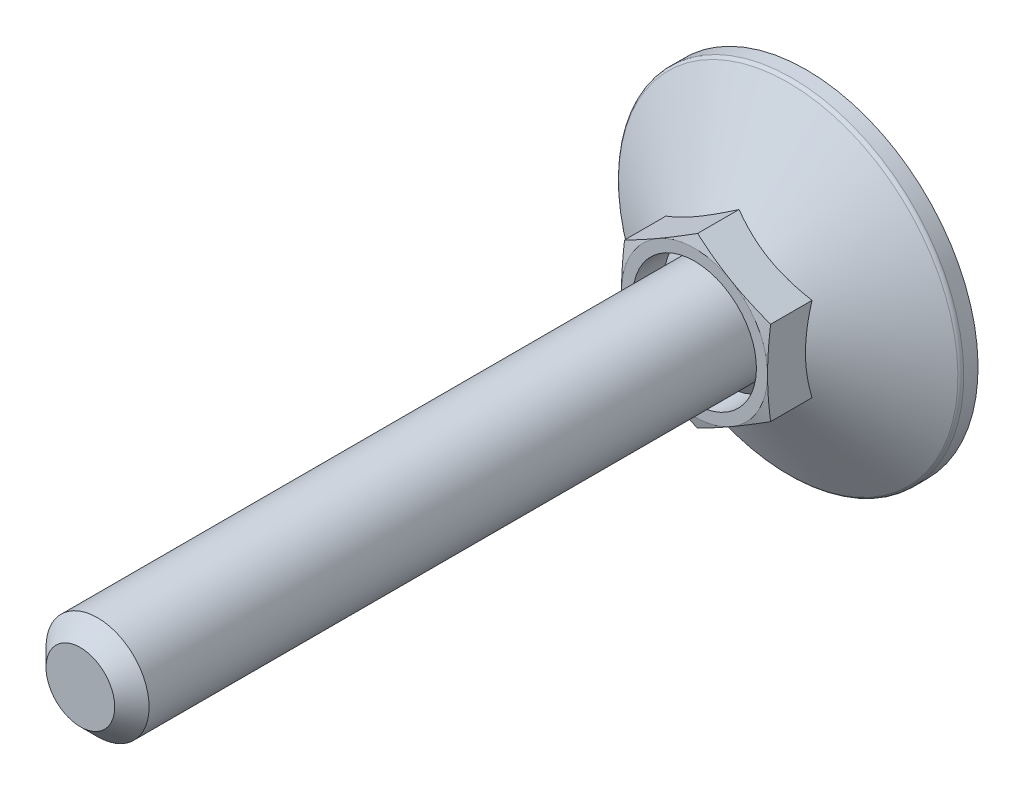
ISO-10303-21;
HEADER;
FILE_DESCRIPTION(('STEP AP214'),'2;1');
FILE_NAME('part.step','',(''),(''),'','','');
FILE_SCHEMA(('AUTOMOTIVE_DESIGN { 1 0 10303 214 1 1 1 1 }'));
ENDSEC;
DATA;
#1=APPLICATION_CONTEXT('core data for automotive mechanical design processes');
#2=APPLICATION_PROTOCOL_DEFINITION('international standard','automotive_design',2000,#1);
#3=PRODUCT_CONTEXT('',#1,'mechanical');
#4=PRODUCT('Part','Part','',(#3));
#5=PRODUCT_RELATED_PRODUCT_CATEGORY('part','',(#4));
#6=PRODUCT_DEFINITION_FORMATION('','',#4);
#7=PRODUCT_DEFINITION_CONTEXT('part definition',#1,'design');
#8=PRODUCT_DEFINITION('design','',#6,#7);
#9=PRODUCT_DEFINITION_SHAPE('','',#8);
#10=(LENGTH_UNIT() NAMED_UNIT(*) SI_UNIT(.MILLI.,.METRE.));
#11=(NAMED_UNIT(*) PLANE_ANGLE_UNIT() SI_UNIT($,.RADIAN.));
#12=(NAMED_UNIT(*) SI_UNIT($,.STERADIAN.) SOLID_ANGLE_UNIT());
#13=UNCERTAINTY_MEASURE_WITH_UNIT(LENGTH_MEASURE(1.E-05),#10,'distance_accuracy_value','');
#14=(GEOMETRIC_REPRESENTATION_CONTEXT(3) GLOBAL_UNCERTAINTY_ASSIGNED_CONTEXT((#13)) GLOBAL_UNIT_ASSIGNED_CONTEXT((#10,
#11,#12)) REPRESENTATION_CONTEXT('',''));
#15=CARTESIAN_POINT('',(0.,0.,0.));
#16=DIRECTION('',(0.,0.,1.));
#17=DIRECTION('',(1.,0.,0.));
#18=AXIS2_PLACEMENT_3D('',#15,#16,#17);
#19=CARTESIAN_POINT('',(0.,0.,0.));
#20=DIRECTION('',(0.,0.,-1.));
#21=DIRECTION('',(0.,1.,0.));
#22=AXIS2_PLACEMENT_3D('',#19,#20,#21);
#23=CYLINDRICAL_SURFACE('',#22,6.);
#24=CARTESIAN_POINT('',(0.,0.,82.5));
#25=DIRECTION('',(0.,0.,1.));
#26=DIRECTION('',(0.,-1.,0.));
#27=AXIS2_PLACEMENT_3D('',#24,#25,#26);
#28=CIRCLE('',#27,6.);
#29=CARTESIAN_POINT('',(0.,-6.,82.5));
#30=VERTEX_POINT('',#29);
#31=EDGE_CURVE('E9',#30,#30,#28,.F.);
#32=ORIENTED_EDGE('',*,*,#31,.T.);
#33=EDGE_LOOP('',(#32));
#34=FACE_BOUND('',#33,.T.);
#35=CARTESIAN_POINT('',(0.,0.,10.0329037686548));
#36=DIRECTION('',(0.,0.,-1.));
#37=DIRECTION('',(0.,1.,0.));
#38=AXIS2_PLACEMENT_3D('',#35,#36,#37);
#39=CIRCLE('',#38,6.);
#40=CARTESIAN_POINT('',(0.,6.,10.0329037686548));
#41=VERTEX_POINT('',#40);
#42=EDGE_CURVE('E180',#41,#41,#39,.F.);
#43=ORIENTED_EDGE('',*,*,#42,.T.);
#44=EDGE_LOOP('',(#43));
#45=FACE_BOUND('',#44,.T.);
#46=ADVANCED_FACE('F14',(#34,#45),#23,.T.);
#47=CARTESIAN_POINT('',(10.2,0.,0.));
#48=DIRECTION('',(0.,0.,1.));
#49=DIRECTION('',(0.,-1.,0.));
#50=AXIS2_PLACEMENT_3D('',#47,#48,#49);
#51=PLANE('',#50);
#52=DIRECTION('',(1.,0.,0.));
#53=VECTOR('',#52,1.);
#54=CARTESIAN_POINT('',(1.,-1.,0.));
#55=LINE('',#54,#53);
#56=CARTESIAN_POINT('',(1.,-1.,0.));
#57=VERTEX_POINT('',#56);
#58=CARTESIAN_POINT('',(6.66666666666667,-1.,0.));
#59=VERTEX_POINT('',#58);
#60=EDGE_CURVE('E706',#57,#59,#55,.T.);
#61=ORIENTED_EDGE('',*,*,#60,.T.);
#62=DIRECTION('',(0.,-1.,0.));
#63=VECTOR('',#62,1.);
#64=CARTESIAN_POINT('',(6.66666666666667,0.,0.));
#65=LINE('',#64,#63);
#66=CARTESIAN_POINT('',(6.66666666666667,1.,0.));
#67=VERTEX_POINT('',#66);
#68=EDGE_CURVE('E379',#67,#59,#65,.T.);
#69=ORIENTED_EDGE('',*,*,#68,.F.);
#70=DIRECTION('',(-1.,0.,0.));
#71=VECTOR('',#70,1.);
#72=CARTESIAN_POINT('',(6.66666666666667,1.,0.));
#73=LINE('',#72,#71);
#74=CARTESIAN_POINT('',(1.,1.,0.));
#75=VERTEX_POINT('',#74);
#76=EDGE_CURVE('E665',#67,#75,#73,.T.);
#77=ORIENTED_EDGE('',*,*,#76,.T.);
#78=DIRECTION('',(0.,1.,0.));
#79=VECTOR('',#78,1.);
#80=CARTESIAN_POINT('',(1.,1.,0.));
#81=LINE('',#80,#79);
#82=CARTESIAN_POINT('',(1.,6.66666666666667,0.));
#83=VERTEX_POINT('',#82);
#84=EDGE_CURVE('E662',#75,#83,#81,.T.);
#85=ORIENTED_EDGE('',*,*,#84,.T.);
#86=DIRECTION('',(-1.,0.,0.));
#87=VECTOR('',#86,1.);
#88=CARTESIAN_POINT('',(1.,6.66666666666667,0.));
#89=LINE('',#88,#87);
#90=CARTESIAN_POINT('',(-1.,6.66666666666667,0.));
#91=VERTEX_POINT('',#90);
#92=EDGE_CURVE('E655',#83,#91,#89,.T.);
#93=ORIENTED_EDGE('',*,*,#92,.T.);
#94=DIRECTION('',(0.,-1.,0.));
#95=VECTOR('',#94,1.);
#96=CARTESIAN_POINT('',(-1.,6.66666666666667,0.));
#97=LINE('',#96,#95);
#98=CARTESIAN_POINT('',(-1.,1.,0.));
#99=VERTEX_POINT('',#98);
#100=EDGE_CURVE('E175',#91,#99,#97,.T.);
#101=ORIENTED_EDGE('',*,*,#100,.T.);
#102=DIRECTION('',(-1.,0.,0.));
#103=VECTOR('',#102,1.);
#104=CARTESIAN_POINT('',(-1.,1.,0.));
#105=LINE('',#104,#103);
#106=CARTESIAN_POINT('',(-6.66666666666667,1.,0.));
#107=VERTEX_POINT('',#106);
#108=EDGE_CURVE('E29',#99,#107,#105,.T.);
#109=ORIENTED_EDGE('',*,*,#108,.T.);
#110=DIRECTION('',(0.,-1.,0.));
#111=VECTOR('',#110,1.);
#112=CARTESIAN_POINT('',(-6.66666666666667,1.,0.));
#113=LINE('',#112,#111);
#114=CARTESIAN_POINT('',(-6.66666666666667,-1.,0.));
#115=VERTEX_POINT('',#114);
#116=EDGE_CURVE('E179',#107,#115,#113,.T.);
#117=ORIENTED_EDGE('',*,*,#116,.T.);
#118=DIRECTION('',(1.,0.,0.));
#119=VECTOR('',#118,1.);
#120=CARTESIAN_POINT('',(-6.66666666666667,-1.,0.));
#121=LINE('',#120,#119);
#122=CARTESIAN_POINT('',(-1.,-1.,0.));
#123=VERTEX_POINT('',#122);
#124=EDGE_CURVE('E690',#115,#123,#121,.T.);
#125=ORIENTED_EDGE('',*,*,#124,.T.);
#126=DIRECTION('',(0.,-1.,0.));
#127=VECTOR('',#126,1.);
#128=CARTESIAN_POINT('',(-1.,-1.,0.));
#129=LINE('',#128,#127);
#130=CARTESIAN_POINT('',(-1.,-6.66666666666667,0.));
#131=VERTEX_POINT('',#130);
#132=EDGE_CURVE('E692',#123,#131,#129,.T.);
#133=ORIENTED_EDGE('',*,*,#132,.T.);
#134=DIRECTION('',(1.,0.,0.));
#135=VECTOR('',#134,1.);
#136=CARTESIAN_POINT('',(-1.,-6.66666666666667,0.));
#137=LINE('',#136,#135);
#138=CARTESIAN_POINT('',(1.,-6.66666666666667,0.));
#139=VERTEX_POINT('',#138);
#140=EDGE_CURVE('E696',#131,#139,#137,.T.);
#141=ORIENTED_EDGE('',*,*,#140,.T.);
#142=DIRECTION('',(0.,1.,0.));
#143=VECTOR('',#142,1.);
#144=CARTESIAN_POINT('',(1.,-6.66666666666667,0.));
#145=LINE('',#144,#143);
#146=EDGE_CURVE('E703',#139,#57,#145,.T.);
#147=ORIENTED_EDGE('',*,*,#146,.T.);
#148=EDGE_LOOP('',(#61,#69,#77,#85,#93,#101,#109,#117,#125,#133,#141,#147));
#149=FACE_BOUND('',#148,.T.);
#150=CARTESIAN_POINT('',(0.,0.,0.));
#151=DIRECTION('',(0.,0.,-1.));
#152=DIRECTION('',(0.,1.,0.));
#153=AXIS2_PLACEMENT_3D('',#150,#151,#152);
#154=CIRCLE('',#153,20.);
#155=CARTESIAN_POINT('',(0.,20.,0.));
#156=VERTEX_POINT('',#155);
#157=EDGE_CURVE('E184',#156,#156,#154,.T.);
#158=ORIENTED_EDGE('',*,*,#157,.T.);
#159=EDGE_LOOP('',(#158));
#160=FACE_BOUND('',#159,.T.);
#161=ADVANCED_FACE('F223',(#149,#160),#51,.F.);
#162=CARTESIAN_POINT('',(0.,0.,13.4970053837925));
#163=DIRECTION('',(0.,0.,-1.));
#164=DIRECTION('',(0.,1.,0.));
#165=AXIS2_PLACEMENT_3D('',#162,#163,#164);
#166=CONICAL_SURFACE('',#165,0.,1.0471975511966);
#167=CARTESIAN_POINT('',(0.,0.,9.34008344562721));
#168=DIRECTION('',(0.,0.,-1.));
#169=DIRECTION('',(0.,1.,0.));
#170=AXIS2_PLACEMENT_3D('',#167,#168,#169);
#171=CIRCLE('',#170,7.2);
#172=CARTESIAN_POINT('',(0.,7.2,9.34008344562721));
#173=VERTEX_POINT('',#172);
#174=EDGE_CURVE('E423',#173,#173,#171,.F.);
#175=ORIENTED_EDGE('',*,*,#174,.T.);
#176=EDGE_LOOP('',(#175));
#177=FACE_BOUND('',#176,.T.);
#178=ORIENTED_EDGE('',*,*,#42,.F.);
#179=EDGE_LOOP('',(#178));
#180=FACE_BOUND('',#179,.T.);
#181=ADVANCED_FACE('F217',(#177,#180),#166,.T.);
#182=CARTESIAN_POINT('',(0.,0.,0.));
#183=DIRECTION('',(0.,0.,-1.));
#184=DIRECTION('',(0.,1.,0.));
#185=AXIS2_PLACEMENT_3D('',#182,#183,#184);
#186=CYLINDRICAL_SURFACE('',#185,7.2);
#187=CARTESIAN_POINT('',(0.,0.,13.));
#188=DIRECTION('',(0.,0.,-1.));
#189=DIRECTION('',(0.,1.,0.));
#190=AXIS2_PLACEMENT_3D('',#187,#188,#189);
#191=CIRCLE('',#190,7.2);
#192=CARTESIAN_POINT('',(0.,7.2,13.));
#193=VERTEX_POINT('',#192);
#194=EDGE_CURVE('E380',#193,#193,#191,.T.);
#195=ORIENTED_EDGE('',*,*,#194,.F.);
#196=EDGE_LOOP('',(#195));
#197=FACE_BOUND('',#196,.T.);
#198=ORIENTED_EDGE('',*,*,#174,.F.);
#199=EDGE_LOOP('',(#198));
#200=FACE_BOUND('',#199,.T.);
#201=ADVANCED_FACE('F222',(#197,#200),#186,.F.);
#202=CARTESIAN_POINT('',(0.,9.81495457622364,199.));
#203=DIRECTION('',(0.5,-0.866025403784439,0.));
#204=DIRECTION('',(0.866025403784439,0.5,0.));
#205=AXIS2_PLACEMENT_3D('',#202,#203,#204);
#206=PLANE('',#205);
#207=CARTESIAN_POINT('',(-8.5002,4.90736181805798,7.83027204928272));
#208=CARTESIAN_POINT('',(-8.31336077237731,5.01523349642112,7.89254195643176));
#209=CARTESIAN_POINT('',(-8.1258249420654,5.1235073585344,7.95198579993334));
#210=CARTESIAN_POINT('',(-7.74923024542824,5.34093440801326,8.06444298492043));
#211=CARTESIAN_POINT('',(-7.56017075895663,5.45008795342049,8.1174535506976));
#212=CARTESIAN_POINT('',(-6.9899652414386,5.77929626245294,8.26579470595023));
#213=CARTESIAN_POINT('',(-6.60656835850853,6.00065055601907,8.3501691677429));
#214=CARTESIAN_POINT('',(-6.03282233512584,6.33190297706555,8.44910807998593));
#215=CARTESIAN_POINT('',(-5.84418723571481,6.44081150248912,8.47729289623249));
#216=CARTESIAN_POINT('',(-5.46606397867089,6.65912106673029,8.52455401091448));
#217=CARTESIAN_POINT('',(-5.27657589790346,6.76852206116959,8.54363111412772));
#218=CARTESIAN_POINT('',(-4.8972734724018,6.98751241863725,8.57219332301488));
#219=CARTESIAN_POINT('',(-4.7074597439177,7.09710142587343,8.58168931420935));
#220=CARTESIAN_POINT('',(-4.32765694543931,7.3163806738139,8.59088571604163));
#221=CARTESIAN_POINT('',(-4.13766788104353,7.42607091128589,8.59058642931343));
#222=CARTESIAN_POINT('',(-3.78247698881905,7.63114046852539,8.58087362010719));
#223=CARTESIAN_POINT('',(-3.6172500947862,7.72653426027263,8.57264492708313));
#224=CARTESIAN_POINT('',(-3.28718328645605,7.9170984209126,8.54893885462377));
#225=CARTESIAN_POINT('',(-3.12234339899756,8.01226877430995,8.53346098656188));
#226=CARTESIAN_POINT('',(-2.62846189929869,8.29741139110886,8.47651947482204));
#227=CARTESIAN_POINT('',(-2.30029449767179,8.48687892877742,8.42455503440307));
#228=CARTESIAN_POINT('',(-1.64047857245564,8.86782383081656,8.29464315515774));
#229=CARTESIAN_POINT('',(-1.30891425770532,9.05925257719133,8.21614502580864));
#230=CARTESIAN_POINT('',(-0.650730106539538,9.43925537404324,8.03798675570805));
#231=CARTESIAN_POINT('',(-0.324101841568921,9.62783429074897,7.93836845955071));
#232=CARTESIAN_POINT('',(0.000199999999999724,9.81507004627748,7.83027204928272));
#233=B_SPLINE_CURVE_WITH_KNOTS('',3,(#207,#208,#209,#210,#211,#212,#213,#214,#215,#216,#217,
#218,#219,#220,#221,#222,#223,#224,#225,#226,#227,#228,#229,#230,#231,#232),.UNSPECIFIED.,.F.,
.F.,(4,2,2,2,2,2,2,2,2,2,2,2,4),(0.,0.673596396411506,1.34748239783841,2.69805431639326,
3.356799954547,4.01548737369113,4.67342558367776,5.33134346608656,5.90409556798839,
6.47688628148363,7.62328361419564,8.79510569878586,9.9646274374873),.UNSPECIFIED.);
#234=CARTESIAN_POINT('',(-8.5,4.90747728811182,7.83033871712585));
#235=VERTEX_POINT('',#234);
#236=CARTESIAN_POINT('',(0.,9.81495457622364,7.83033871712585));
#237=VERTEX_POINT('',#236);
#238=EDGE_CURVE('E256',#235,#237,#233,.T.);
#239=ORIENTED_EDGE('',*,*,#238,.F.);
#240=DIRECTION('',(0.,0.,-1.));
#241=VECTOR('',#240,1.);
#242=CARTESIAN_POINT('',(-8.5,4.90747728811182,199.));
#243=LINE('',#242,#241);
#244=CARTESIAN_POINT('',(-8.5,4.90747728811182,12.6476589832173));
#245=VERTEX_POINT('',#244);
#246=EDGE_CURVE('E431',#245,#235,#243,.T.);
#247=ORIENTED_EDGE('',*,*,#246,.F.);
#248=CARTESIAN_POINT('',(0.000200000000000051,9.81507004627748,12.6476280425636));
#249=CARTESIAN_POINT('',(-0.352800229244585,9.61126526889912,12.7022599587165));
#250=CARTESIAN_POINT('',(-0.706440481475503,9.40709097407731,12.7518566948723));
#251=CARTESIAN_POINT('',(-1.41496987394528,8.99802133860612,12.8389934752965));
#252=CARTESIAN_POINT('',(-1.76985946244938,8.79312573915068,12.8765286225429));
#253=CARTESIAN_POINT('',(-2.47873586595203,8.38385575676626,12.9373509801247));
#254=CARTESIAN_POINT('',(-2.83271788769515,8.17948414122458,12.9607107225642));
#255=CARTESIAN_POINT('',(-3.5411333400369,7.77048028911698,12.9920337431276));
#256=CARTESIAN_POINT('',(-3.89556667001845,7.56584811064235,13.));
#257=CARTESIAN_POINT('',(-4.60443332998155,7.15658375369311,13.));
#258=CARTESIAN_POINT('',(-4.9588666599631,6.95195157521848,12.9920337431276));
#259=CARTESIAN_POINT('',(-5.66728211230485,6.54294772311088,12.9607107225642));
#260=CARTESIAN_POINT('',(-6.02126413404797,6.33857610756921,12.9373509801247));
#261=CARTESIAN_POINT('',(-6.73014053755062,5.92930612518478,12.8765286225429));
#262=CARTESIAN_POINT('',(-7.08503012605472,5.72441052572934,12.8389934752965));
#263=CARTESIAN_POINT('',(-7.7935595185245,5.31534089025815,12.7518566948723));
#264=CARTESIAN_POINT('',(-8.14719977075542,5.11116659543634,12.7022599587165));
#265=CARTESIAN_POINT('',(-8.5002,4.90736181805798,12.6476280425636));
#266=B_SPLINE_CURVE_WITH_KNOTS('',3,(#248,#249,#250,#251,#252,#253,#254,#255,#256,#257,#258,
#259,#260,#261,#262,#263,#264,#265),.UNSPECIFIED.,.F.,.F.,(4,2,2,2,2,2,2,2,4),(0.,
1.23382789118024,2.46815608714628,3.69611406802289,4.92383440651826,6.15155474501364,
7.37951272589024,8.61384092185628,9.84766881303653),.UNSPECIFIED.);
#267=CARTESIAN_POINT('',(-4.25,7.36121593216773,13.));
#268=VERTEX_POINT('',#267);
#269=EDGE_CURVE('E286',#268,#245,#266,.T.);
#270=ORIENTED_EDGE('',*,*,#269,.F.);
#271=CARTESIAN_POINT('',(0.,9.81495457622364,12.6476589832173));
#272=VERTEX_POINT('',#271);
#273=EDGE_CURVE('E395',#272,#268,#266,.T.);
#274=ORIENTED_EDGE('',*,*,#273,.F.);
#275=DIRECTION('',(0.,0.,-1.));
#276=VECTOR('',#275,1.);
#277=CARTESIAN_POINT('',(0.,9.81495457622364,199.));
#278=LINE('',#277,#276);
#279=EDGE_CURVE('E415',#272,#237,#278,.T.);
#280=ORIENTED_EDGE('',*,*,#279,.T.);
#281=EDGE_LOOP('',(#239,#247,#270,#274,#280));
#282=FACE_BOUND('',#281,.T.);
#283=ADVANCED_FACE('F228',(#282),#206,.F.);
#284=CARTESIAN_POINT('',(8.5,4.90747728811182,199.));
#285=DIRECTION('',(-0.5,-0.866025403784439,0.));
#286=DIRECTION('',(0.866025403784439,-0.5,0.));
#287=AXIS2_PLACEMENT_3D('',#284,#285,#286);
#288=PLANE('',#287);
#289=CARTESIAN_POINT('',(-0.0002,9.81507004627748,7.83027204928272));
#290=CARTESIAN_POINT('',(0.186639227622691,9.70719836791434,7.89254195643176));
#291=CARTESIAN_POINT('',(0.374175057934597,9.59892450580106,7.95198579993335));
#292=CARTESIAN_POINT('',(0.750769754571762,9.3814974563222,8.06444298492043));
#293=CARTESIAN_POINT('',(0.939829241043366,9.27234391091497,8.1174535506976));
#294=CARTESIAN_POINT('',(1.5100347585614,8.94313560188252,8.26579470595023));
#295=CARTESIAN_POINT('',(1.89343164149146,8.72178130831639,8.3501691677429));
#296=CARTESIAN_POINT('',(2.46717766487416,8.39052888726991,8.44910807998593));
#297=CARTESIAN_POINT('',(2.65581276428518,8.28162036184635,8.47729289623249));
#298=CARTESIAN_POINT('',(3.03393602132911,8.06331079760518,8.52455401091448));
#299=CARTESIAN_POINT('',(3.22342410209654,7.95390980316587,8.54363111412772));
#300=CARTESIAN_POINT('',(3.6027265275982,7.73491944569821,8.57219332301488));
#301=CARTESIAN_POINT('',(3.79254025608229,7.62533043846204,8.58168931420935));
#302=CARTESIAN_POINT('',(4.17234305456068,7.40605119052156,8.59088571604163));
#303=CARTESIAN_POINT('',(4.36233211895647,7.29636095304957,8.59058642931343));
#304=CARTESIAN_POINT('',(4.71752301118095,7.09129139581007,8.58087362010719));
#305=CARTESIAN_POINT('',(4.8827499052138,6.99589760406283,8.57264492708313));
#306=CARTESIAN_POINT('',(5.21281671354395,6.80533344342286,8.54893885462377));
#307=CARTESIAN_POINT('',(5.37765660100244,6.71016309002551,8.53346098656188));
#308=CARTESIAN_POINT('',(5.87153810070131,6.42502047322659,8.47651947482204));
#309=CARTESIAN_POINT('',(6.19970550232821,6.23555293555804,8.42455503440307));
#310=CARTESIAN_POINT('',(6.85952142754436,5.8546080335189,8.29464315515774));
#311=CARTESIAN_POINT('',(7.19108574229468,5.66317928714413,8.21614502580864));
#312=CARTESIAN_POINT('',(7.84926989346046,5.28317649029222,8.03798675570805));
#313=CARTESIAN_POINT('',(8.17589815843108,5.09459757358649,7.93836845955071));
#314=CARTESIAN_POINT('',(8.5002,4.90736181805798,7.83027204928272));
#315=B_SPLINE_CURVE_WITH_KNOTS('',3,(#289,#290,#291,#292,#293,#294,#295,#296,#297,#298,#299,
#300,#301,#302,#303,#304,#305,#306,#307,#308,#309,#310,#311,#312,#313,#314),.UNSPECIFIED.,.F.,
.F.,(4,2,2,2,2,2,2,2,2,2,2,2,4),(0.,0.673596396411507,1.34748239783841,2.69805431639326,
3.35679995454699,4.01548737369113,4.67342558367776,5.33134346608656,5.90409556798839,
6.47688628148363,7.62328361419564,8.79510569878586,9.9646274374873),.UNSPECIFIED.);
#316=CARTESIAN_POINT('',(8.5,4.90747728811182,7.83033871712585));
#317=VERTEX_POINT('',#316);
#318=EDGE_CURVE('E37',#237,#317,#315,.T.);
#319=ORIENTED_EDGE('',*,*,#318,.F.);
#320=ORIENTED_EDGE('',*,*,#279,.F.);
#321=CARTESIAN_POINT('',(8.5002,4.90736181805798,12.6476280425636));
#322=CARTESIAN_POINT('',(8.14719977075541,5.11116659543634,12.7022599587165));
#323=CARTESIAN_POINT('',(7.7935595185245,5.31534089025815,12.7518566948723));
#324=CARTESIAN_POINT('',(7.08503012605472,5.72441052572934,12.8389934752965));
#325=CARTESIAN_POINT('',(6.73014053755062,5.92930612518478,12.8765286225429));
#326=CARTESIAN_POINT('',(6.02126413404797,6.33857610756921,12.9373509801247));
#327=CARTESIAN_POINT('',(5.66728211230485,6.54294772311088,12.9607107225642));
#328=CARTESIAN_POINT('',(4.9588666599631,6.95195157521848,12.9920337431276));
#329=CARTESIAN_POINT('',(4.60443332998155,7.15658375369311,13.));
#330=CARTESIAN_POINT('',(3.89556667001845,7.56584811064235,13.));
#331=CARTESIAN_POINT('',(3.5411333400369,7.77048028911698,12.9920337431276));
#332=CARTESIAN_POINT('',(2.83271788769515,8.17948414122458,12.9607107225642));
#333=CARTESIAN_POINT('',(2.47873586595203,8.38385575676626,12.9373509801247));
#334=CARTESIAN_POINT('',(1.76985946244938,8.79312573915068,12.8765286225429));
#335=CARTESIAN_POINT('',(1.41496987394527,8.99802133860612,12.8389934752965));
#336=CARTESIAN_POINT('',(0.7064404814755,9.40709097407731,12.7518566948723));
#337=CARTESIAN_POINT('',(0.352800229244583,9.61126526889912,12.7022599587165));
#338=CARTESIAN_POINT('',(-0.000200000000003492,9.81507004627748,12.6476280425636));
#339=B_SPLINE_CURVE_WITH_KNOTS('',3,(#321,#322,#323,#324,#325,#326,#327,#328,#329,#330,#331,
#332,#333,#334,#335,#336,#337,#338),.UNSPECIFIED.,.F.,.F.,(4,2,2,2,2,2,2,2,4),(0.,
1.23382789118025,2.46815608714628,3.69611406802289,4.92383440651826,6.15155474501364,
7.37951272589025,8.61384092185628,9.84766881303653),.UNSPECIFIED.);
#340=CARTESIAN_POINT('',(4.25,7.36121593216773,13.));
#341=VERTEX_POINT('',#340);
#342=EDGE_CURVE('E269',#341,#272,#339,.T.);
#343=ORIENTED_EDGE('',*,*,#342,.F.);
#344=CARTESIAN_POINT('',(8.5,4.90747728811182,12.6476589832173));
#345=VERTEX_POINT('',#344);
#346=EDGE_CURVE('E278',#345,#341,#339,.T.);
#347=ORIENTED_EDGE('',*,*,#346,.F.);
#348=DIRECTION('',(0.,0.,-1.));
#349=VECTOR('',#348,1.);
#350=CARTESIAN_POINT('',(8.5,4.90747728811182,199.));
#351=LINE('',#350,#349);
#352=EDGE_CURVE('E417',#345,#317,#351,.T.);
#353=ORIENTED_EDGE('',*,*,#352,.T.);
#354=EDGE_LOOP('',(#319,#320,#343,#347,#353));
#355=FACE_BOUND('',#354,.T.);
#356=ADVANCED_FACE('F262',(#355),#288,.F.);
#357=CARTESIAN_POINT('',(8.5,-4.90747728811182,199.));
#358=DIRECTION('',(-1.,0.,0.));
#359=DIRECTION('',(0.,-1.,0.));
#360=AXIS2_PLACEMENT_3D('',#357,#358,#359);
#361=PLANE('',#360);
#362=CARTESIAN_POINT('',(8.5,12.8220542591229,4.61528116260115));
#363=CARTESIAN_POINT('',(8.5,12.4534155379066,4.79262377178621));
#364=CARTESIAN_POINT('',(8.5,12.0838902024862,4.96815716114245));
#365=CARTESIAN_POINT('',(8.5,11.3425927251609,5.31457894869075));
#366=CARTESIAN_POINT('',(8.5,10.9708202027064,5.48546653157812));
#367=CARTESIAN_POINT('',(8.5,10.2224625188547,5.82250763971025));
#368=CARTESIAN_POINT('',(8.5,9.84586188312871,5.98862693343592));
#369=CARTESIAN_POINT('',(8.5,9.08953299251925,6.31355867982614));
#370=CARTESIAN_POINT('',(8.5,8.70980489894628,6.47237150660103));
#371=CARTESIAN_POINT('',(8.5,7.93635853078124,6.78489169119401));
#372=CARTESIAN_POINT('',(8.5,7.5425381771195,6.93834789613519));
#373=CARTESIAN_POINT('',(8.5,6.75016193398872,7.23275009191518));
#374=CARTESIAN_POINT('',(8.5,6.35160550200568,7.37369463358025));
#375=CARTESIAN_POINT('',(8.5,5.54998630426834,7.63911020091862));
#376=CARTESIAN_POINT('',(8.5,5.14693580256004,7.76361784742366));
#377=CARTESIAN_POINT('',(8.5,4.33508769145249,7.99193558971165));
#378=CARTESIAN_POINT('',(8.5,3.92629204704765,8.09575258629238));
#379=CARTESIAN_POINT('',(8.5,3.10458766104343,8.27700176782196));
#380=CARTESIAN_POINT('',(8.5,2.69170444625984,8.35454642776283));
#381=CARTESIAN_POINT('',(8.5,2.06892742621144,8.44757828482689));
#382=CARTESIAN_POINT('',(8.5,1.86074253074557,8.47470931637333));
#383=CARTESIAN_POINT('',(8.5,1.44346514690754,8.52067173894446));
#384=CARTESIAN_POINT('',(8.5,1.23437274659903,8.5395039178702));
#385=CARTESIAN_POINT('',(8.5,0.818123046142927,8.5682751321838));
#386=CARTESIAN_POINT('',(8.5,0.6109730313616,8.57831925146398));
#387=CARTESIAN_POINT('',(8.5,0.196434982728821,8.58967320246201));
#388=CARTESIAN_POINT('',(8.5,-0.0109530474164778,8.59098316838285));
#389=CARTESIAN_POINT('',(8.5,-0.425608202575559,8.58483724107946));
#390=CARTESIAN_POINT('',(8.5,-0.632875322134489,8.57738097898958));
#391=CARTESIAN_POINT('',(8.5,-1.04692490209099,8.55387613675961));
#392=CARTESIAN_POINT('',(8.5,-1.25370733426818,8.5378270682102));
#393=CARTESIAN_POINT('',(8.5,-1.76172684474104,8.48816674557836));
#394=CARTESIAN_POINT('',(8.5,-2.06251418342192,8.44986872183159));
#395=CARTESIAN_POINT('',(8.5,-2.66160170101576,8.35726697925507));
#396=CARTESIAN_POINT('',(8.5,-2.95990148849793,8.30296078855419));
#397=CARTESIAN_POINT('',(8.5,-3.85084347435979,8.11893322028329));
#398=CARTESIAN_POINT('',(8.5,-4.4391769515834,7.96814146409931));
#399=CARTESIAN_POINT('',(8.5,-5.31919968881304,7.70971639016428));
#400=CARTESIAN_POINT('',(8.5,-5.61551051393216,7.61694416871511));
#401=CARTESIAN_POINT('',(8.5,-6.20524874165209,7.4225646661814));
#402=CARTESIAN_POINT('',(8.5,-6.4986761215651,7.3209573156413));
#403=CARTESIAN_POINT('',(8.5,-7.08276471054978,7.11046965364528));
#404=CARTESIAN_POINT('',(8.5,-7.37342689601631,7.0015920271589));
#405=CARTESIAN_POINT('',(8.5,-7.95239195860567,6.77777126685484));
#406=CARTESIAN_POINT('',(8.5,-8.2406948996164,6.66282829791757));
#407=CARTESIAN_POINT('',(8.5,-8.80562449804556,6.43181846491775));
#408=CARTESIAN_POINT('',(8.5,-9.08231928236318,6.31591764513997));
#409=CARTESIAN_POINT('',(8.5,-9.63401072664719,6.0801365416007));
#410=CARTESIAN_POINT('',(8.5,-9.90900735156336,5.96025617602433));
#411=CARTESIAN_POINT('',(8.5,-10.7318217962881,5.59557173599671));
#412=CARTESIAN_POINT('',(8.5,-11.2774137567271,5.34574521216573));
#413=CARTESIAN_POINT('',(8.5,-12.3642460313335,4.83628492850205));
#414=CARTESIAN_POINT('',(8.5,-12.905484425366,4.57664710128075));
#415=CARTESIAN_POINT('',(8.5,-13.9843891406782,4.05013469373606));
#416=CARTESIAN_POINT('',(8.5,-14.5220556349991,3.78326046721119));
#417=CARTESIAN_POINT('',(8.5,-15.5954930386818,3.24355438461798));
#418=CARTESIAN_POINT('',(8.5,-16.1312593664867,2.97071343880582));
#419=CARTESIAN_POINT('',(8.5,-17.2005865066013,2.4207361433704));
#420=CARTESIAN_POINT('',(8.5,-17.7341472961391,2.14359974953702));
#421=CARTESIAN_POINT('',(8.5,-18.7993643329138,1.58600707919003));
#422=CARTESIAN_POINT('',(8.5,-19.3310210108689,1.30555162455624));
#423=CARTESIAN_POINT('',(8.5,-20.3928917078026,0.741921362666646));
#424=CARTESIAN_POINT('',(8.5,-20.9231057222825,0.458746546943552));
#425=CARTESIAN_POINT('',(8.5,-22.3874236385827,-0.32722037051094));
#426=CARTESIAN_POINT('',(8.5,-23.3202800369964,-0.83233607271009));
#427=CARTESIAN_POINT('',(8.5,-25.1833983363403,-1.84747335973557));
#428=CARTESIAN_POINT('',(8.5,-26.1136600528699,-2.35749528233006));
#429=CARTESIAN_POINT('',(8.5,-27.9692131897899,-3.37950461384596));
#430=CARTESIAN_POINT('',(8.5,-28.8945109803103,-3.89148046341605));
#431=CARTESIAN_POINT('',(8.5,-30.2812847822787,-4.66146611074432));
#432=CARTESIAN_POINT('',(8.5,-30.7433285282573,-4.91845451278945));
#433=CARTESIAN_POINT('',(8.5,-31.6670795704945,-5.43303439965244));
#434=CARTESIAN_POINT('',(8.5,-32.1287868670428,-5.69062588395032));
#435=CARTESIAN_POINT('',(8.5,-32.5903473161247,-5.94848028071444));
#436=B_SPLINE_CURVE_WITH_KNOTS('',3,(#362,#363,#364,#365,#366,#367,#368,#369,#370,#371,#372,
#373,#374,#375,#376,#377,#378,#379,#380,#381,#382,#383,#384,#385,#386,#387,#388,#389,#390,#391,
#392,#393,#394,#395,#396,#397,#398,#399,#400,#401,#402,#403,#404,#405,#406,#407,#408,#409,#410,
#411,#412,#413,#414,#415,#416,#417,#418,#419,#420,#421,#422,#423,#424,#425,#426,#427,#428,#429,
#430,#431,#432,#433,#434,#435),.UNSPECIFIED.,.F.,.F.,(4,2,2,2,2,2,2,2,2,2,2,2,2,2,2,2,2,2,2,2,2,
2,2,2,2,2,2,2,2,2,2,2,2,2,2,2,4),(0.,1.22725127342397,2.45471654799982,3.68948778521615,
4.92419572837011,6.19201746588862,7.45998585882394,8.72507978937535,9.98975107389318,
11.2489376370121,11.878634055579,12.5082706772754,13.1302712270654,13.7522622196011,
14.3742793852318,14.9963319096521,15.9054589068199,16.814726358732,18.6343169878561,
19.5657329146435,20.4971561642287,21.4282373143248,22.3592931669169,23.259222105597,
24.1591695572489,25.9592281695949,27.7600413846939,29.5607667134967,31.3644583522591,
33.1681685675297,34.9714411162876,36.7747192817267,39.9571898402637,43.1398810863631,
46.3123590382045,47.8984694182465,49.4845784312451),.UNSPECIFIED.);
#437=CARTESIAN_POINT('',(8.5,-4.90747728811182,7.83033871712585));
#438=VERTEX_POINT('',#437);
#439=EDGE_CURVE('E245',#317,#438,#436,.T.);
#440=ORIENTED_EDGE('',*,*,#439,.F.);
#441=ORIENTED_EDGE('',*,*,#352,.F.);
#442=CARTESIAN_POINT('',(8.5,12.9820891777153,11.1197370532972));
#443=CARTESIAN_POINT('',(8.5,12.5964686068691,11.2061594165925));
#444=CARTESIAN_POINT('',(8.5,12.2106068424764,11.2915248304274));
#445=CARTESIAN_POINT('',(8.5,11.4382824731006,11.4595712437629));
#446=CARTESIAN_POINT('',(8.5,11.0518198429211,11.5422521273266));
#447=CARTESIAN_POINT('',(8.5,10.2778290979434,11.7044309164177));
#448=CARTESIAN_POINT('',(8.5,9.89030030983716,11.7839256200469));
#449=CARTESIAN_POINT('',(8.5,9.11443612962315,11.9388739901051));
#450=CARTESIAN_POINT('',(8.5,8.72610074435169,12.0143276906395));
#451=CARTESIAN_POINT('',(8.5,7.95158013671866,12.159650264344));
#452=CARTESIAN_POINT('',(8.5,7.56540239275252,12.2295587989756));
#453=CARTESIAN_POINT('',(8.5,6.79199352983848,12.3632725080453));
#454=CARTESIAN_POINT('',(8.5,6.40476243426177,12.4270778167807));
#455=CARTESIAN_POINT('',(8.5,5.62917169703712,12.54714843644));
#456=CARTESIAN_POINT('',(8.5,5.24081220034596,12.6034146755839));
#457=CARTESIAN_POINT('',(8.5,4.46285737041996,12.70674908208));
#458=CARTESIAN_POINT('',(8.5,4.07326203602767,12.7538172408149));
#459=CARTESIAN_POINT('',(8.5,3.28844017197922,12.8374226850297));
#460=CARTESIAN_POINT('',(8.5,2.89320002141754,12.8738340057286));
#461=CARTESIAN_POINT('',(8.5,2.10172608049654,12.9336139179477));
#462=CARTESIAN_POINT('',(8.5,1.70549231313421,12.9569828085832));
#463=CARTESIAN_POINT('',(8.5,0.912605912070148,12.9893148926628));
#464=CARTESIAN_POINT('',(8.5,0.515953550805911,12.9982846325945));
#465=CARTESIAN_POINT('',(8.5,-0.27740821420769,13.0012669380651));
#466=CARTESIAN_POINT('',(8.5,-0.674117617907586,12.9952795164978));
#467=CARTESIAN_POINT('',(8.5,-1.46847963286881,12.9686842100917));
#468=CARTESIAN_POINT('',(8.5,-1.86613043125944,12.9480232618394));
#469=CARTESIAN_POINT('',(8.5,-2.66049684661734,12.8932602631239));
#470=CARTESIAN_POINT('',(8.5,-3.05721244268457,12.8591579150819));
#471=CARTESIAN_POINT('',(8.5,-3.84970511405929,12.7792347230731));
#472=CARTESIAN_POINT('',(8.5,-4.24548140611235,12.7334062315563));
#473=CARTESIAN_POINT('',(8.5,-5.03576028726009,12.6319377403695));
#474=CARTESIAN_POINT('',(8.5,-5.43026287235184,12.5762977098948));
#475=CARTESIAN_POINT('',(8.5,-6.19195385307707,12.4609360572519));
#476=CARTESIAN_POINT('',(8.5,-6.55922094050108,12.4017287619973));
#477=CARTESIAN_POINT('',(8.5,-7.29278719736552,12.2775674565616));
#478=CARTESIAN_POINT('',(8.5,-7.65908634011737,12.2126132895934));
#479=CARTESIAN_POINT('',(8.5,-8.39085027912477,12.078008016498));
#480=CARTESIAN_POINT('',(8.5,-8.75631499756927,12.0083564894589));
#481=CARTESIAN_POINT('',(8.5,-9.48649515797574,11.8652200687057));
#482=CARTESIAN_POINT('',(8.5,-9.85121059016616,11.7917351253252));
#483=CARTESIAN_POINT('',(8.5,-10.5800753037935,11.6416087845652));
#484=CARTESIAN_POINT('',(8.5,-10.944224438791,11.5649666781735));
#485=CARTESIAN_POINT('',(8.5,-11.6719684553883,11.4090909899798));
#486=CARTESIAN_POINT('',(8.5,-12.0355633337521,11.3298573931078));
#487=CARTESIAN_POINT('',(8.5,-13.1255915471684,11.0889686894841));
#488=CARTESIAN_POINT('',(8.5,-13.8513178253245,10.9241153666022));
#489=CARTESIAN_POINT('',(8.5,-15.2942598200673,10.590109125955));
#490=CARTESIAN_POINT('',(8.5,-16.0114890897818,10.421014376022));
#491=CARTESIAN_POINT('',(8.5,-17.4449475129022,10.0785875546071));
#492=CARTESIAN_POINT('',(8.5,-18.1611766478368,9.9052554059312));
#493=CARTESIAN_POINT('',(8.5,-19.5919856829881,9.55567998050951));
#494=CARTESIAN_POINT('',(8.5,-20.306566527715,9.37944056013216));
#495=CARTESIAN_POINT('',(8.5,-21.7351057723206,9.02455520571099));
#496=CARTESIAN_POINT('',(8.5,-22.4490641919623,8.84590935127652));
#497=CARTESIAN_POINT('',(8.5,-23.1628057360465,8.66641079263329));
#498=B_SPLINE_CURVE_WITH_KNOTS('',3,(#442,#443,#444,#445,#446,#447,#448,#449,#450,#451,#452,
#453,#454,#455,#456,#457,#458,#459,#460,#461,#462,#463,#464,#465,#466,#467,#468,#469,#470,#471,
#472,#473,#474,#475,#476,#477,#478,#479,#480,#481,#482,#483,#484,#485,#486,#487,#488,#489,#490,
#491,#492,#493,#494,#495,#496,#497),.UNSPECIFIED.,.F.,.F.,(4,2,2,2,2,2,2,2,2,2,2,2,2,2,2,2,2,2,
2,2,2,2,2,2,2,2,2,4),(0.,1.18556310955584,2.37117735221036,3.5579546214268,4.74472187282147,
5.92204594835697,7.09934411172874,8.27649719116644,9.45365137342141,10.6442044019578,
11.8347301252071,13.0247144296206,14.2146977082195,15.4090063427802,16.6033414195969,
17.7984574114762,18.9935771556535,20.1095500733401,21.2255534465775,22.3416569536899,
23.4577749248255,24.5741449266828,25.6905214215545,27.9231231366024,30.1337863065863,
32.3444897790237,34.5524651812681,36.7603677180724),.UNSPECIFIED.);
#499=CARTESIAN_POINT('',(8.5,0.,13.));
#500=VERTEX_POINT('',#499);
#501=EDGE_CURVE('E280',#500,#345,#498,.F.);
#502=ORIENTED_EDGE('',*,*,#501,.F.);
#503=CARTESIAN_POINT('',(8.5,-4.90747728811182,12.6476589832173));
#504=VERTEX_POINT('',#503);
#505=EDGE_CURVE('E279',#504,#500,#498,.F.);
#506=ORIENTED_EDGE('',*,*,#505,.F.);
#507=DIRECTION('',(0.,0.,-1.));
#508=VECTOR('',#507,1.);
#509=CARTESIAN_POINT('',(8.5,-4.90747728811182,199.));
#510=LINE('',#509,#508);
#511=EDGE_CURVE('E421',#504,#438,#510,.T.);
#512=ORIENTED_EDGE('',*,*,#511,.T.);
#513=EDGE_LOOP('',(#440,#441,#502,#506,#512));
#514=FACE_BOUND('',#513,.T.);
#515=ADVANCED_FACE('F265',(#514),#361,.F.);
#516=CARTESIAN_POINT('',(0.,-9.81495457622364,199.));
#517=DIRECTION('',(-0.5,0.866025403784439,0.));
#518=DIRECTION('',(-0.866025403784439,-0.5,0.));
#519=AXIS2_PLACEMENT_3D('',#516,#517,#518);
#520=PLANE('',#519);
#521=CARTESIAN_POINT('',(8.5002,-4.90736181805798,7.83027204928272));
#522=CARTESIAN_POINT('',(8.31336077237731,-5.01523349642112,7.89254195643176));
#523=CARTESIAN_POINT('',(8.1258249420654,-5.1235073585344,7.95198579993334));
#524=CARTESIAN_POINT('',(7.74923024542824,-5.34093440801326,8.06444298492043));
#525=CARTESIAN_POINT('',(7.56017075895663,-5.45008795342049,8.1174535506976));
#526=CARTESIAN_POINT('',(6.9899652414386,-5.77929626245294,8.26579470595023));
#527=CARTESIAN_POINT('',(6.60656835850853,-6.00065055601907,8.3501691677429));
#528=CARTESIAN_POINT('',(6.03282233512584,-6.33190297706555,8.44910807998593));
#529=CARTESIAN_POINT('',(5.84418723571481,-6.44081150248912,8.47729289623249));
#530=CARTESIAN_POINT('',(5.46606397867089,-6.65912106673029,8.52455401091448));
#531=CARTESIAN_POINT('',(5.27657589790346,-6.76852206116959,8.54363111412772));
#532=CARTESIAN_POINT('',(4.8972734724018,-6.98751241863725,8.57219332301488));
#533=CARTESIAN_POINT('',(4.7074597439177,-7.09710142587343,8.58168931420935));
#534=CARTESIAN_POINT('',(4.32765694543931,-7.3163806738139,8.59088571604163));
#535=CARTESIAN_POINT('',(4.13766788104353,-7.42607091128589,8.59058642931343));
#536=CARTESIAN_POINT('',(3.78247698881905,-7.63114046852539,8.58087362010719));
#537=CARTESIAN_POINT('',(3.6172500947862,-7.72653426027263,8.57264492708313));
#538=CARTESIAN_POINT('',(3.28718328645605,-7.9170984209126,8.54893885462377));
#539=CARTESIAN_POINT('',(3.12234339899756,-8.01226877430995,8.53346098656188));
#540=CARTESIAN_POINT('',(2.62846189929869,-8.29741139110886,8.47651947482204));
#541=CARTESIAN_POINT('',(2.30029449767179,-8.48687892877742,8.42455503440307));
#542=CARTESIAN_POINT('',(1.64047857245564,-8.86782383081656,8.29464315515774));
#543=CARTESIAN_POINT('',(1.30891425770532,-9.05925257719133,8.21614502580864));
#544=CARTESIAN_POINT('',(0.650730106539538,-9.43925537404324,8.03798675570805));
#545=CARTESIAN_POINT('',(0.324101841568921,-9.62783429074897,7.93836845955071));
#546=CARTESIAN_POINT('',(-0.000199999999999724,-9.81507004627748,7.83027204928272));
#547=B_SPLINE_CURVE_WITH_KNOTS('',3,(#521,#522,#523,#524,#525,#526,#527,#528,#529,#530,#531,
#532,#533,#534,#535,#536,#537,#538,#539,#540,#541,#542,#543,#544,#545,#546),.UNSPECIFIED.,.F.,
.F.,(4,2,2,2,2,2,2,2,2,2,2,2,4),(0.,0.673596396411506,1.34748239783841,2.69805431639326,
3.356799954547,4.01548737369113,4.67342558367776,5.33134346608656,5.90409556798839,
6.47688628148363,7.62328361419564,8.79510569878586,9.9646274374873),.UNSPECIFIED.);
#548=CARTESIAN_POINT('',(0.,-9.81495457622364,7.83033871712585));
#549=VERTEX_POINT('',#548);
#550=EDGE_CURVE('E207',#438,#549,#547,.T.);
#551=ORIENTED_EDGE('',*,*,#550,.F.);
#552=ORIENTED_EDGE('',*,*,#511,.F.);
#553=CARTESIAN_POINT('',(-0.000200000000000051,-9.81507004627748,12.6476280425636));
#554=CARTESIAN_POINT('',(0.352800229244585,-9.61126526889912,12.7022599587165));
#555=CARTESIAN_POINT('',(0.706440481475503,-9.40709097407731,12.7518566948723));
#556=CARTESIAN_POINT('',(1.41496987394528,-8.99802133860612,12.8389934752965));
#557=CARTESIAN_POINT('',(1.76985946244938,-8.79312573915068,12.8765286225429));
#558=CARTESIAN_POINT('',(2.47873586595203,-8.38385575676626,12.9373509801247));
#559=CARTESIAN_POINT('',(2.83271788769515,-8.17948414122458,12.9607107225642));
#560=CARTESIAN_POINT('',(3.5411333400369,-7.77048028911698,12.9920337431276));
#561=CARTESIAN_POINT('',(3.89556667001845,-7.56584811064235,13.));
#562=CARTESIAN_POINT('',(4.60443332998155,-7.15658375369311,13.));
#563=CARTESIAN_POINT('',(4.9588666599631,-6.95195157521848,12.9920337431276));
#564=CARTESIAN_POINT('',(5.66728211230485,-6.54294772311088,12.9607107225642));
#565=CARTESIAN_POINT('',(6.02126413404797,-6.33857610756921,12.9373509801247));
#566=CARTESIAN_POINT('',(6.73014053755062,-5.92930612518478,12.8765286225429));
#567=CARTESIAN_POINT('',(7.08503012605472,-5.72441052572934,12.8389934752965));
#568=CARTESIAN_POINT('',(7.7935595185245,-5.31534089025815,12.7518566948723));
#569=CARTESIAN_POINT('',(8.14719977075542,-5.11116659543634,12.7022599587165));
#570=CARTESIAN_POINT('',(8.5002,-4.90736181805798,12.6476280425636));
#571=B_SPLINE_CURVE_WITH_KNOTS('',3,(#553,#554,#555,#556,#557,#558,#559,#560,#561,#562,#563,
#564,#565,#566,#567,#568,#569,#570),.UNSPECIFIED.,.F.,.F.,(4,2,2,2,2,2,2,2,4),(0.,
1.23382789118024,2.46815608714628,3.69611406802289,4.92383440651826,6.15155474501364,
7.37951272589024,8.61384092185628,9.84766881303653),.UNSPECIFIED.);
#572=CARTESIAN_POINT('',(4.25,-7.36121593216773,13.));
#573=VERTEX_POINT('',#572);
#574=EDGE_CURVE('E320',#573,#504,#571,.T.);
#575=ORIENTED_EDGE('',*,*,#574,.F.);
#576=CARTESIAN_POINT('',(0.,-9.81495457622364,12.6476589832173));
#577=VERTEX_POINT('',#576);
#578=EDGE_CURVE('E326',#577,#573,#571,.T.);
#579=ORIENTED_EDGE('',*,*,#578,.F.);
#580=DIRECTION('',(0.,0.,-1.));
#581=VECTOR('',#580,1.);
#582=CARTESIAN_POINT('',(0.,-9.81495457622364,199.));
#583=LINE('',#582,#581);
#584=EDGE_CURVE('E427',#577,#549,#583,.T.);
#585=ORIENTED_EDGE('',*,*,#584,.T.);
#586=EDGE_LOOP('',(#551,#552,#575,#579,#585));
#587=FACE_BOUND('',#586,.T.);
#588=ADVANCED_FACE('F328',(#587),#520,.F.);
#589=CARTESIAN_POINT('',(-8.5,-4.90747728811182,199.));
#590=DIRECTION('',(0.5,0.866025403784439,0.));
#591=DIRECTION('',(-0.866025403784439,0.5,0.));
#592=AXIS2_PLACEMENT_3D('',#589,#590,#591);
#593=PLANE('',#592);
#594=CARTESIAN_POINT('',(0.0002,-9.81507004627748,7.83027204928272));
#595=CARTESIAN_POINT('',(-0.186639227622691,-9.70719836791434,7.89254195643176));
#596=CARTESIAN_POINT('',(-0.374175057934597,-9.59892450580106,7.95198579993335));
#597=CARTESIAN_POINT('',(-0.750769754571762,-9.3814974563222,8.06444298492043));
#598=CARTESIAN_POINT('',(-0.939829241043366,-9.27234391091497,8.1174535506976));
#599=CARTESIAN_POINT('',(-1.5100347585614,-8.94313560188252,8.26579470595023));
#600=CARTESIAN_POINT('',(-1.89343164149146,-8.72178130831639,8.3501691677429));
#601=CARTESIAN_POINT('',(-2.46717766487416,-8.39052888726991,8.44910807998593));
#602=CARTESIAN_POINT('',(-2.65581276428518,-8.28162036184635,8.47729289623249));
#603=CARTESIAN_POINT('',(-3.03393602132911,-8.06331079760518,8.52455401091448));
#604=CARTESIAN_POINT('',(-3.22342410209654,-7.95390980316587,8.54363111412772));
#605=CARTESIAN_POINT('',(-3.6027265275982,-7.73491944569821,8.57219332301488));
#606=CARTESIAN_POINT('',(-3.79254025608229,-7.62533043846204,8.58168931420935));
#607=CARTESIAN_POINT('',(-4.17234305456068,-7.40605119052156,8.59088571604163));
#608=CARTESIAN_POINT('',(-4.36233211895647,-7.29636095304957,8.59058642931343));
#609=CARTESIAN_POINT('',(-4.71752301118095,-7.09129139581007,8.58087362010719));
#610=CARTESIAN_POINT('',(-4.8827499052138,-6.99589760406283,8.57264492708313));
#611=CARTESIAN_POINT('',(-5.21281671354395,-6.80533344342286,8.54893885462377));
#612=CARTESIAN_POINT('',(-5.37765660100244,-6.71016309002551,8.53346098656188));
#613=CARTESIAN_POINT('',(-5.87153810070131,-6.42502047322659,8.47651947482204));
#614=CARTESIAN_POINT('',(-6.19970550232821,-6.23555293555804,8.42455503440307));
#615=CARTESIAN_POINT('',(-6.85952142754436,-5.8546080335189,8.29464315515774));
#616=CARTESIAN_POINT('',(-7.19108574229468,-5.66317928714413,8.21614502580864));
#617=CARTESIAN_POINT('',(-7.84926989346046,-5.28317649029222,8.03798675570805));
#618=CARTESIAN_POINT('',(-8.17589815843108,-5.09459757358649,7.93836845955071));
#619=CARTESIAN_POINT('',(-8.5002,-4.90736181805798,7.83027204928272));
#620=B_SPLINE_CURVE_WITH_KNOTS('',3,(#594,#595,#596,#597,#598,#599,#600,#601,#602,#603,#604,
#605,#606,#607,#608,#609,#610,#611,#612,#613,#614,#615,#616,#617,#618,#619),.UNSPECIFIED.,.F.,
.F.,(4,2,2,2,2,2,2,2,2,2,2,2,4),(0.,0.673596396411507,1.34748239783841,2.69805431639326,
3.35679995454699,4.01548737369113,4.67342558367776,5.33134346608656,5.90409556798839,
6.47688628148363,7.62328361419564,8.79510569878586,9.9646274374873),.UNSPECIFIED.);
#621=CARTESIAN_POINT('',(-8.5,-4.90747728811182,7.83033871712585));
#622=VERTEX_POINT('',#621);
#623=EDGE_CURVE('E198',#549,#622,#620,.T.);
#624=ORIENTED_EDGE('',*,*,#623,.F.);
#625=ORIENTED_EDGE('',*,*,#584,.F.);
#626=CARTESIAN_POINT('',(-8.5002,-4.90736181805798,12.6476280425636));
#627=CARTESIAN_POINT('',(-8.14719977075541,-5.11116659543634,12.7022599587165));
#628=CARTESIAN_POINT('',(-7.7935595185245,-5.31534089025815,12.7518566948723));
#629=CARTESIAN_POINT('',(-7.08503012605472,-5.72441052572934,12.8389934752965));
#630=CARTESIAN_POINT('',(-6.73014053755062,-5.92930612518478,12.8765286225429));
#631=CARTESIAN_POINT('',(-6.02126413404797,-6.33857610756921,12.9373509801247));
#632=CARTESIAN_POINT('',(-5.66728211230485,-6.54294772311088,12.9607107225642));
#633=CARTESIAN_POINT('',(-4.9588666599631,-6.95195157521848,12.9920337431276));
#634=CARTESIAN_POINT('',(-4.60443332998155,-7.15658375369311,13.));
#635=CARTESIAN_POINT('',(-3.89556667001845,-7.56584811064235,13.));
#636=CARTESIAN_POINT('',(-3.5411333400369,-7.77048028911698,12.9920337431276));
#637=CARTESIAN_POINT('',(-2.83271788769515,-8.17948414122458,12.9607107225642));
#638=CARTESIAN_POINT('',(-2.47873586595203,-8.38385575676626,12.9373509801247));
#639=CARTESIAN_POINT('',(-1.76985946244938,-8.79312573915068,12.8765286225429));
#640=CARTESIAN_POINT('',(-1.41496987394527,-8.99802133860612,12.8389934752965));
#641=CARTESIAN_POINT('',(-0.7064404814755,-9.40709097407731,12.7518566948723));
#642=CARTESIAN_POINT('',(-0.352800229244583,-9.61126526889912,12.7022599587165));
#643=CARTESIAN_POINT('',(0.000200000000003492,-9.81507004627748,12.6476280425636));
#644=B_SPLINE_CURVE_WITH_KNOTS('',3,(#626,#627,#628,#629,#630,#631,#632,#633,#634,#635,#636,
#637,#638,#639,#640,#641,#642,#643),.UNSPECIFIED.,.F.,.F.,(4,2,2,2,2,2,2,2,4),(0.,
1.23382789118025,2.46815608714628,3.69611406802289,4.92383440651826,6.15155474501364,
7.37951272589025,8.61384092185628,9.84766881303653),.UNSPECIFIED.);
#645=CARTESIAN_POINT('',(-4.25,-7.36121593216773,13.));
#646=VERTEX_POINT('',#645);
#647=EDGE_CURVE('E314',#646,#577,#644,.T.);
#648=ORIENTED_EDGE('',*,*,#647,.F.);
#649=CARTESIAN_POINT('',(-8.5,-4.90747728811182,12.6476589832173));
#650=VERTEX_POINT('',#649);
#651=EDGE_CURVE('E327',#650,#646,#644,.T.);
#652=ORIENTED_EDGE('',*,*,#651,.F.);
#653=DIRECTION('',(0.,0.,-1.));
#654=VECTOR('',#653,1.);
#655=CARTESIAN_POINT('',(-8.5,-4.90747728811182,199.));
#656=LINE('',#655,#654);
#657=EDGE_CURVE('E430',#650,#622,#656,.T.);
#658=ORIENTED_EDGE('',*,*,#657,.T.);
#659=EDGE_LOOP('',(#624,#625,#648,#652,#658));
#660=FACE_BOUND('',#659,.T.);
#661=ADVANCED_FACE('F214',(#660),#593,.F.);
#662=CARTESIAN_POINT('',(-8.5,4.90747728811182,199.));
#663=DIRECTION('',(1.,0.,0.));
#664=DIRECTION('',(0.,1.,0.));
#665=AXIS2_PLACEMENT_3D('',#662,#663,#664);
#666=PLANE('',#665);
#667=CARTESIAN_POINT('',(-8.5,12.8220542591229,4.61528116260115));
#668=CARTESIAN_POINT('',(-8.5,12.4534155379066,4.79262377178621));
#669=CARTESIAN_POINT('',(-8.5,12.0838902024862,4.96815716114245));
#670=CARTESIAN_POINT('',(-8.5,11.3425927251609,5.31457894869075));
#671=CARTESIAN_POINT('',(-8.5,10.9708202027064,5.48546653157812));
#672=CARTESIAN_POINT('',(-8.5,10.2224625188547,5.82250763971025));
#673=CARTESIAN_POINT('',(-8.5,9.84586188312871,5.98862693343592));
#674=CARTESIAN_POINT('',(-8.5,9.08953299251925,6.31355867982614));
#675=CARTESIAN_POINT('',(-8.5,8.70980489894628,6.47237150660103));
#676=CARTESIAN_POINT('',(-8.5,7.93635853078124,6.78489169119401));
#677=CARTESIAN_POINT('',(-8.5,7.5425381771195,6.93834789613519));
#678=CARTESIAN_POINT('',(-8.5,6.75016193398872,7.23275009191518));
#679=CARTESIAN_POINT('',(-8.5,6.35160550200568,7.37369463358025));
#680=CARTESIAN_POINT('',(-8.5,5.54998630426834,7.63911020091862));
#681=CARTESIAN_POINT('',(-8.5,5.14693580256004,7.76361784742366));
#682=CARTESIAN_POINT('',(-8.5,4.33508769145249,7.99193558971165));
#683=CARTESIAN_POINT('',(-8.5,3.92629204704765,8.09575258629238));
#684=CARTESIAN_POINT('',(-8.5,3.10458766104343,8.27700176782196));
#685=CARTESIAN_POINT('',(-8.5,2.69170444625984,8.35454642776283));
#686=CARTESIAN_POINT('',(-8.5,2.06892742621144,8.44757828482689));
#687=CARTESIAN_POINT('',(-8.5,1.86074253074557,8.47470931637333));
#688=CARTESIAN_POINT('',(-8.5,1.44346514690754,8.52067173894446));
#689=CARTESIAN_POINT('',(-8.5,1.23437274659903,8.5395039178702));
#690=CARTESIAN_POINT('',(-8.5,0.818123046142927,8.5682751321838));
#691=CARTESIAN_POINT('',(-8.5,0.6109730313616,8.57831925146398));
#692=CARTESIAN_POINT('',(-8.5,0.196434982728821,8.58967320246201));
#693=CARTESIAN_POINT('',(-8.5,-0.0109530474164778,8.59098316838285));
#694=CARTESIAN_POINT('',(-8.5,-0.425608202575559,8.58483724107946));
#695=CARTESIAN_POINT('',(-8.5,-0.632875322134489,8.57738097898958));
#696=CARTESIAN_POINT('',(-8.5,-1.04692490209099,8.55387613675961));
#697=CARTESIAN_POINT('',(-8.5,-1.25370733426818,8.5378270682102));
#698=CARTESIAN_POINT('',(-8.5,-1.76172684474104,8.48816674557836));
#699=CARTESIAN_POINT('',(-8.5,-2.06251418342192,8.44986872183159));
#700=CARTESIAN_POINT('',(-8.5,-2.66160170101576,8.35726697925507));
#701=CARTESIAN_POINT('',(-8.5,-2.95990148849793,8.30296078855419));
#702=CARTESIAN_POINT('',(-8.5,-3.85084347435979,8.11893322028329));
#703=CARTESIAN_POINT('',(-8.5,-4.4391769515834,7.96814146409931));
#704=CARTESIAN_POINT('',(-8.5,-5.31919968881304,7.70971639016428));
#705=CARTESIAN_POINT('',(-8.5,-5.61551051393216,7.61694416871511));
#706=CARTESIAN_POINT('',(-8.5,-6.20524874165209,7.4225646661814));
#707=CARTESIAN_POINT('',(-8.5,-6.4986761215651,7.3209573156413));
#708=CARTESIAN_POINT('',(-8.5,-7.08276471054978,7.11046965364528));
#709=CARTESIAN_POINT('',(-8.5,-7.37342689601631,7.0015920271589));
#710=CARTESIAN_POINT('',(-8.5,-7.95239195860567,6.77777126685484));
#711=CARTESIAN_POINT('',(-8.5,-8.2406948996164,6.66282829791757));
#712=CARTESIAN_POINT('',(-8.5,-8.80562449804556,6.43181846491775));
#713=CARTESIAN_POINT('',(-8.5,-9.08231928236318,6.31591764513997));
#714=CARTESIAN_POINT('',(-8.5,-9.63401072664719,6.0801365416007));
#715=CARTESIAN_POINT('',(-8.5,-9.90900735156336,5.96025617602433));
#716=CARTESIAN_POINT('',(-8.5,-10.7318217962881,5.59557173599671));
#717=CARTESIAN_POINT('',(-8.5,-11.2774137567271,5.34574521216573));
#718=CARTESIAN_POINT('',(-8.5,-12.3642460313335,4.83628492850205));
#719=CARTESIAN_POINT('',(-8.5,-12.905484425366,4.57664710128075));
#720=CARTESIAN_POINT('',(-8.5,-13.9843891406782,4.05013469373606));
#721=CARTESIAN_POINT('',(-8.5,-14.5220556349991,3.78326046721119));
#722=CARTESIAN_POINT('',(-8.5,-15.5954930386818,3.24355438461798));
#723=CARTESIAN_POINT('',(-8.5,-16.1312593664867,2.97071343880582));
#724=CARTESIAN_POINT('',(-8.5,-17.2005865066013,2.4207361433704));
#725=CARTESIAN_POINT('',(-8.5,-17.7341472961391,2.14359974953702));
#726=CARTESIAN_POINT('',(-8.5,-18.7993643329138,1.58600707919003));
#727=CARTESIAN_POINT('',(-8.5,-19.3310210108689,1.30555162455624));
#728=CARTESIAN_POINT('',(-8.5,-20.3928917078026,0.741921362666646));
#729=CARTESIAN_POINT('',(-8.5,-20.9231057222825,0.458746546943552));
#730=CARTESIAN_POINT('',(-8.5,-22.3874236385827,-0.32722037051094));
#731=CARTESIAN_POINT('',(-8.5,-23.3202800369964,-0.83233607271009));
#732=CARTESIAN_POINT('',(-8.5,-25.1833983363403,-1.84747335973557));
#733=CARTESIAN_POINT('',(-8.5,-26.1136600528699,-2.35749528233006));
#734=CARTESIAN_POINT('',(-8.5,-27.9692131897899,-3.37950461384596));
#735=CARTESIAN_POINT('',(-8.5,-28.8945109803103,-3.89148046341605));
#736=CARTESIAN_POINT('',(-8.5,-30.2812847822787,-4.66146611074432));
#737=CARTESIAN_POINT('',(-8.5,-30.7433285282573,-4.91845451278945));
#738=CARTESIAN_POINT('',(-8.5,-31.6670795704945,-5.43303439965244));
#739=CARTESIAN_POINT('',(-8.5,-32.1287868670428,-5.69062588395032));
#740=CARTESIAN_POINT('',(-8.5,-32.5903473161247,-5.94848028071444));
#741=B_SPLINE_CURVE_WITH_KNOTS('',3,(#667,#668,#669,#670,#671,#672,#673,#674,#675,#676,#677,
#678,#679,#680,#681,#682,#683,#684,#685,#686,#687,#688,#689,#690,#691,#692,#693,#694,#695,#696,
#697,#698,#699,#700,#701,#702,#703,#704,#705,#706,#707,#708,#709,#710,#711,#712,#713,#714,#715,
#716,#717,#718,#719,#720,#721,#722,#723,#724,#725,#726,#727,#728,#729,#730,#731,#732,#733,#734,
#735,#736,#737,#738,#739,#740),.UNSPECIFIED.,.F.,.F.,(4,2,2,2,2,2,2,2,2,2,2,2,2,2,2,2,2,2,2,2,2,
2,2,2,2,2,2,2,2,2,2,2,2,2,2,2,4),(0.,1.22725127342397,2.45471654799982,3.68948778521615,
4.92419572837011,6.19201746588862,7.45998585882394,8.72507978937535,9.98975107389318,
11.2489376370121,11.878634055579,12.5082706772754,13.1302712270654,13.7522622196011,
14.3742793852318,14.9963319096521,15.9054589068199,16.814726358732,18.6343169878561,
19.5657329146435,20.4971561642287,21.4282373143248,22.3592931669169,23.259222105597,
24.1591695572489,25.9592281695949,27.7600413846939,29.5607667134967,31.3644583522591,
33.1681685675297,34.9714411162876,36.7747192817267,39.9571898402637,43.1398810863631,
46.3123590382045,47.8984694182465,49.4845784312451),.UNSPECIFIED.);
#742=EDGE_CURVE('E234',#622,#235,#741,.F.);
#743=ORIENTED_EDGE('',*,*,#742,.F.);
#744=ORIENTED_EDGE('',*,*,#657,.F.);
#745=CARTESIAN_POINT('',(-8.5,12.9820891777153,11.1197370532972));
#746=CARTESIAN_POINT('',(-8.5,12.5964686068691,11.2061594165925));
#747=CARTESIAN_POINT('',(-8.5,12.2106068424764,11.2915248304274));
#748=CARTESIAN_POINT('',(-8.5,11.4382824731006,11.4595712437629));
#749=CARTESIAN_POINT('',(-8.5,11.0518198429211,11.5422521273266));
#750=CARTESIAN_POINT('',(-8.5,10.2778290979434,11.7044309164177));
#751=CARTESIAN_POINT('',(-8.5,9.89030030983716,11.7839256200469));
#752=CARTESIAN_POINT('',(-8.5,9.11443612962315,11.9388739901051));
#753=CARTESIAN_POINT('',(-8.5,8.72610074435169,12.0143276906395));
#754=CARTESIAN_POINT('',(-8.5,7.95158013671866,12.159650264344));
#755=CARTESIAN_POINT('',(-8.5,7.56540239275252,12.2295587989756));
#756=CARTESIAN_POINT('',(-8.5,6.79199352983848,12.3632725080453));
#757=CARTESIAN_POINT('',(-8.5,6.40476243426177,12.4270778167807));
#758=CARTESIAN_POINT('',(-8.5,5.62917169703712,12.54714843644));
#759=CARTESIAN_POINT('',(-8.5,5.24081220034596,12.6034146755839));
#760=CARTESIAN_POINT('',(-8.5,4.46285737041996,12.70674908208));
#761=CARTESIAN_POINT('',(-8.5,4.07326203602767,12.7538172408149));
#762=CARTESIAN_POINT('',(-8.5,3.28844017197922,12.8374226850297));
#763=CARTESIAN_POINT('',(-8.5,2.89320002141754,12.8738340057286));
#764=CARTESIAN_POINT('',(-8.5,2.10172608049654,12.9336139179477));
#765=CARTESIAN_POINT('',(-8.5,1.70549231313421,12.9569828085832));
#766=CARTESIAN_POINT('',(-8.5,0.912605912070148,12.9893148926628));
#767=CARTESIAN_POINT('',(-8.5,0.515953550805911,12.9982846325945));
#768=CARTESIAN_POINT('',(-8.5,-0.27740821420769,13.0012669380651));
#769=CARTESIAN_POINT('',(-8.5,-0.674117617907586,12.9952795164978));
#770=CARTESIAN_POINT('',(-8.5,-1.46847963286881,12.9686842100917));
#771=CARTESIAN_POINT('',(-8.5,-1.86613043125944,12.9480232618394));
#772=CARTESIAN_POINT('',(-8.5,-2.66049684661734,12.8932602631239));
#773=CARTESIAN_POINT('',(-8.5,-3.05721244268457,12.8591579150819));
#774=CARTESIAN_POINT('',(-8.5,-3.84970511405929,12.7792347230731));
#775=CARTESIAN_POINT('',(-8.5,-4.24548140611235,12.7334062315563));
#776=CARTESIAN_POINT('',(-8.5,-5.03576028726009,12.6319377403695));
#777=CARTESIAN_POINT('',(-8.5,-5.43026287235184,12.5762977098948));
#778=CARTESIAN_POINT('',(-8.5,-6.19195385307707,12.4609360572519));
#779=CARTESIAN_POINT('',(-8.5,-6.55922094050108,12.4017287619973));
#780=CARTESIAN_POINT('',(-8.5,-7.29278719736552,12.2775674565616));
#781=CARTESIAN_POINT('',(-8.5,-7.65908634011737,12.2126132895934));
#782=CARTESIAN_POINT('',(-8.5,-8.39085027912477,12.078008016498));
#783=CARTESIAN_POINT('',(-8.5,-8.75631499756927,12.0083564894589));
#784=CARTESIAN_POINT('',(-8.5,-9.48649515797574,11.8652200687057));
#785=CARTESIAN_POINT('',(-8.5,-9.85121059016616,11.7917351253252));
#786=CARTESIAN_POINT('',(-8.5,-10.5800753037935,11.6416087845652));
#787=CARTESIAN_POINT('',(-8.5,-10.944224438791,11.5649666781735));
#788=CARTESIAN_POINT('',(-8.5,-11.6719684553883,11.4090909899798));
#789=CARTESIAN_POINT('',(-8.5,-12.0355633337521,11.3298573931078));
#790=CARTESIAN_POINT('',(-8.5,-13.1255915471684,11.0889686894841));
#791=CARTESIAN_POINT('',(-8.5,-13.8513178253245,10.9241153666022));
#792=CARTESIAN_POINT('',(-8.5,-15.2942598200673,10.590109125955));
#793=CARTESIAN_POINT('',(-8.5,-16.0114890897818,10.421014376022));
#794=CARTESIAN_POINT('',(-8.5,-17.4449475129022,10.0785875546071));
#795=CARTESIAN_POINT('',(-8.5,-18.1611766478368,9.9052554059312));
#796=CARTESIAN_POINT('',(-8.5,-19.5919856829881,9.55567998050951));
#797=CARTESIAN_POINT('',(-8.5,-20.306566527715,9.37944056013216));
#798=CARTESIAN_POINT('',(-8.5,-21.7351057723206,9.02455520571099));
#799=CARTESIAN_POINT('',(-8.5,-22.4490641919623,8.84590935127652));
#800=CARTESIAN_POINT('',(-8.5,-23.1628057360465,8.66641079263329));
#801=B_SPLINE_CURVE_WITH_KNOTS('',3,(#745,#746,#747,#748,#749,#750,#751,#752,#753,#754,#755,
#756,#757,#758,#759,#760,#761,#762,#763,#764,#765,#766,#767,#768,#769,#770,#771,#772,#773,#774,
#775,#776,#777,#778,#779,#780,#781,#782,#783,#784,#785,#786,#787,#788,#789,#790,#791,#792,#793,
#794,#795,#796,#797,#798,#799,#800),.UNSPECIFIED.,.F.,.F.,(4,2,2,2,2,2,2,2,2,2,2,2,2,2,2,2,2,2,
2,2,2,2,2,2,2,2,2,4),(0.,1.18556310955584,2.37117735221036,3.5579546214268,4.74472187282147,
5.92204594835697,7.09934411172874,8.27649719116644,9.45365137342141,10.6442044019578,
11.8347301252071,13.0247144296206,14.2146977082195,15.4090063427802,16.6033414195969,
17.7984574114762,18.9935771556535,20.1095500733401,21.2255534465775,22.3416569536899,
23.4577749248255,24.5741449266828,25.6905214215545,27.9231231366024,30.1337863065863,
32.3444897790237,34.5524651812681,36.7603677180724),.UNSPECIFIED.);
#802=CARTESIAN_POINT('',(-8.5,0.,13.));
#803=VERTEX_POINT('',#802);
#804=EDGE_CURVE('E305',#803,#650,#801,.T.);
#805=ORIENTED_EDGE('',*,*,#804,.F.);
#806=EDGE_CURVE('E420',#245,#803,#801,.T.);
#807=ORIENTED_EDGE('',*,*,#806,.F.);
#808=ORIENTED_EDGE('',*,*,#246,.T.);
#809=EDGE_LOOP('',(#743,#744,#805,#807,#808));
#810=FACE_BOUND('',#809,.T.);
#811=ADVANCED_FACE('F339',(#810),#666,.F.);
#812=CARTESIAN_POINT('',(0.,0.,13.));
#813=DIRECTION('',(0.,0.,-1.));
#814=DIRECTION('',(0.,1.,0.));
#815=AXIS2_PLACEMENT_3D('',#812,#813,#814);
#816=CONICAL_SURFACE('',#815,8.5,1.30899693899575);
#817=ORIENTED_EDGE('',*,*,#574,.T.);
#818=ORIENTED_EDGE('',*,*,#505,.T.);
#819=CARTESIAN_POINT('',(0.,0.,13.));
#820=DIRECTION('',(0.,0.,-1.));
#821=DIRECTION('',(0.,1.,0.));
#822=AXIS2_PLACEMENT_3D('',#819,#820,#821);
#823=CIRCLE('',#822,8.5);
#824=EDGE_CURVE('E382',#500,#573,#823,.T.);
#825=ORIENTED_EDGE('',*,*,#824,.T.);
#826=EDGE_LOOP('',(#817,#818,#825));
#827=FACE_BOUND('',#826,.T.);
#828=ADVANCED_FACE('F300',(#827),#816,.T.);
#829=EDGE_CURVE('E387',#341,#500,#823,.T.);
#830=ORIENTED_EDGE('',*,*,#829,.T.);
#831=ORIENTED_EDGE('',*,*,#501,.T.);
#832=ORIENTED_EDGE('',*,*,#346,.T.);
#833=EDGE_LOOP('',(#830,#831,#832));
#834=FACE_BOUND('',#833,.T.);
#835=ADVANCED_FACE('F409',(#834),#816,.T.);
#836=EDGE_CURVE('E394',#268,#341,#823,.T.);
#837=ORIENTED_EDGE('',*,*,#836,.T.);
#838=ORIENTED_EDGE('',*,*,#342,.T.);
#839=ORIENTED_EDGE('',*,*,#273,.T.);
#840=EDGE_LOOP('',(#837,#838,#839));
#841=FACE_BOUND('',#840,.T.);
#842=ADVANCED_FACE('F414',(#841),#816,.T.);
#843=ORIENTED_EDGE('',*,*,#647,.T.);
#844=ORIENTED_EDGE('',*,*,#578,.T.);
#845=EDGE_CURVE('E386',#573,#646,#823,.T.);
#846=ORIENTED_EDGE('',*,*,#845,.T.);
#847=EDGE_LOOP('',(#843,#844,#846));
#848=FACE_BOUND('',#847,.T.);
#849=ADVANCED_FACE('F752',(#848),#816,.T.);
#850=EDGE_CURVE('E401',#803,#268,#823,.T.);
#851=ORIENTED_EDGE('',*,*,#850,.T.);
#852=ORIENTED_EDGE('',*,*,#269,.T.);
#853=ORIENTED_EDGE('',*,*,#806,.T.);
#854=EDGE_LOOP('',(#851,#852,#853));
#855=FACE_BOUND('',#854,.T.);
#856=ADVANCED_FACE('F301',(#855),#816,.T.);
#857=CARTESIAN_POINT('',(7.2,0.,13.));
#858=DIRECTION('',(0.,0.,-1.));
#859=DIRECTION('',(0.,1.,0.));
#860=AXIS2_PLACEMENT_3D('',#857,#858,#859);
#861=PLANE('',#860);
#862=ORIENTED_EDGE('',*,*,#824,.F.);
#863=ORIENTED_EDGE('',*,*,#829,.F.);
#864=ORIENTED_EDGE('',*,*,#836,.F.);
#865=ORIENTED_EDGE('',*,*,#850,.F.);
#866=EDGE_CURVE('E392',#646,#803,#823,.T.);
#867=ORIENTED_EDGE('',*,*,#866,.F.);
#868=ORIENTED_EDGE('',*,*,#845,.F.);
#869=EDGE_LOOP('',(#862,#863,#864,#865,#867,#868));
#870=FACE_BOUND('',#869,.T.);
#871=ORIENTED_EDGE('',*,*,#194,.T.);
#872=EDGE_LOOP('',(#871));
#873=FACE_BOUND('',#872,.T.);
#874=ADVANCED_FACE('F298',(#870,#873),#861,.F.);
#875=ORIENTED_EDGE('',*,*,#804,.T.);
#876=ORIENTED_EDGE('',*,*,#651,.T.);
#877=ORIENTED_EDGE('',*,*,#866,.T.);
#878=EDGE_LOOP('',(#875,#876,#877));
#879=FACE_BOUND('',#878,.T.);
#880=ADVANCED_FACE('F292',(#879),#816,.T.);
#881=CARTESIAN_POINT('',(0.,0.,0.));
#882=DIRECTION('',(0.,0.,-1.));
#883=DIRECTION('',(0.,1.,0.));
#884=AXIS2_PLACEMENT_3D('',#881,#882,#883);
#885=CYLINDRICAL_SURFACE('',#884,20.);
#886=ORIENTED_EDGE('',*,*,#157,.F.);
#887=EDGE_LOOP('',(#886));
#888=FACE_BOUND('',#887,.T.);
#889=CARTESIAN_POINT('',(0.,0.,1.66132486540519));
#890=DIRECTION('',(0.,0.,-1.));
#891=DIRECTION('',(0.,1.,0.));
#892=AXIS2_PLACEMENT_3D('',#889,#890,#891);
#893=CIRCLE('',#892,20.);
#894=CARTESIAN_POINT('',(0.,20.,1.66132486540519));
#895=VERTEX_POINT('',#894);
#896=EDGE_CURVE('E192',#895,#895,#893,.T.);
#897=ORIENTED_EDGE('',*,*,#896,.T.);
#898=EDGE_LOOP('',(#897));
#899=FACE_BOUND('',#898,.T.);
#900=ADVANCED_FACE('F297',(#888,#899),#885,.T.);
#901=CARTESIAN_POINT('',(0.,0.,1.66132486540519));
#902=DIRECTION('',(0.,0.,-1.));
#903=DIRECTION('',(0.,1.,0.));
#904=AXIS2_PLACEMENT_3D('',#901,#902,#903);
#905=TOROIDAL_SURFACE('',#904,19.5,0.5);
#906=CARTESIAN_POINT('',(0.,0.,2.0943375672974));
#907=DIRECTION('',(0.,0.,-1.));
#908=DIRECTION('',(0.,1.,0.));
#909=AXIS2_PLACEMENT_3D('',#906,#907,#908);
#910=CIRCLE('',#909,19.75);
#911=CARTESIAN_POINT('',(0.,19.75,2.0943375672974));
#912=VERTEX_POINT('',#911);
#913=EDGE_CURVE('E195',#912,#912,#910,.T.);
#914=ORIENTED_EDGE('',*,*,#913,.T.);
#915=EDGE_LOOP('',(#914));
#916=FACE_BOUND('',#915,.T.);
#917=ORIENTED_EDGE('',*,*,#896,.F.);
#918=EDGE_LOOP('',(#917));
#919=FACE_BOUND('',#918,.T.);
#920=ADVANCED_FACE('F226',(#916,#919),#905,.T.);
#921=ORIENTED_EDGE('',*,*,#913,.F.);
#922=EDGE_LOOP('',(#921));
#923=FACE_BOUND('',#922,.T.);
#924=ORIENTED_EDGE('',*,*,#742,.T.);
#925=ORIENTED_EDGE('',*,*,#238,.T.);
#926=ORIENTED_EDGE('',*,*,#318,.T.);
#927=ORIENTED_EDGE('',*,*,#439,.T.);
#928=ORIENTED_EDGE('',*,*,#550,.T.);
#929=ORIENTED_EDGE('',*,*,#623,.T.);
#930=EDGE_LOOP('',(#924,#925,#926,#927,#928,#929));
#931=FACE_BOUND('',#930,.T.);
#932=ADVANCED_FACE('F225',(#923,#931),#166,.T.);
#933=CARTESIAN_POINT('',(-1.,1.,1.));
#934=DIRECTION('',(0.,-1.,0.));
#935=DIRECTION('',(1.,0.,0.));
#936=AXIS2_PLACEMENT_3D('',#933,#934,#935);
#937=PLANE('',#936);
#938=ORIENTED_EDGE('',*,*,#108,.F.);
#939=DIRECTION('',(0.,0.,-1.));
#940=VECTOR('',#939,1.);
#941=CARTESIAN_POINT('',(-1.,1.,1.));
#942=LINE('',#941,#940);
#943=CARTESIAN_POINT('',(-1.,1.,1.));
#944=VERTEX_POINT('',#943);
#945=EDGE_CURVE('E174',#944,#99,#942,.T.);
#946=ORIENTED_EDGE('',*,*,#945,.F.);
#947=DIRECTION('',(-1.,0.,0.));
#948=VECTOR('',#947,1.);
#949=CARTESIAN_POINT('',(-1.,1.,1.));
#950=LINE('',#949,#948);
#951=CARTESIAN_POINT('',(-6.66666666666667,1.,1.));
#952=VERTEX_POINT('',#951);
#953=EDGE_CURVE('E165',#944,#952,#950,.T.);
#954=ORIENTED_EDGE('',*,*,#953,.T.);
#955=DIRECTION('',(0.,0.,-1.));
#956=VECTOR('',#955,1.);
#957=CARTESIAN_POINT('',(-6.66666666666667,1.,1.));
#958=LINE('',#957,#956);
#959=EDGE_CURVE('E173',#952,#107,#958,.T.);
#960=ORIENTED_EDGE('',*,*,#959,.T.);
#961=EDGE_LOOP('',(#938,#946,#954,#960));
#962=FACE_BOUND('',#961,.T.);
#963=ADVANCED_FACE('F172',(#962),#937,.T.);
#964=CARTESIAN_POINT('',(-6.66666666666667,1.,1.));
#965=DIRECTION('',(1.,0.,0.));
#966=DIRECTION('',(0.,1.,0.));
#967=AXIS2_PLACEMENT_3D('',#964,#965,#966);
#968=PLANE('',#967);
#969=ORIENTED_EDGE('',*,*,#116,.F.);
#970=ORIENTED_EDGE('',*,*,#959,.F.);
#971=DIRECTION('',(0.,-1.,0.));
#972=VECTOR('',#971,1.);
#973=CARTESIAN_POINT('',(-6.66666666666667,1.,1.));
#974=LINE('',#973,#972);
#975=CARTESIAN_POINT('',(-6.66666666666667,-1.,1.));
#976=VERTEX_POINT('',#975);
#977=EDGE_CURVE('E161',#952,#976,#974,.T.);
#978=ORIENTED_EDGE('',*,*,#977,.T.);
#979=DIRECTION('',(0.,0.,-1.));
#980=VECTOR('',#979,1.);
#981=CARTESIAN_POINT('',(-6.66666666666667,-1.,1.));
#982=LINE('',#981,#980);
#983=EDGE_CURVE('E181',#976,#115,#982,.T.);
#984=ORIENTED_EDGE('',*,*,#983,.T.);
#985=EDGE_LOOP('',(#969,#970,#978,#984));
#986=FACE_BOUND('',#985,.T.);
#987=ADVANCED_FACE('F177',(#986),#968,.T.);
#988=CARTESIAN_POINT('',(-6.66666666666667,-1.,1.));
#989=DIRECTION('',(0.,1.,0.));
#990=DIRECTION('',(-1.,0.,0.));
#991=AXIS2_PLACEMENT_3D('',#988,#989,#990);
#992=PLANE('',#991);
#993=ORIENTED_EDGE('',*,*,#124,.F.);
#994=ORIENTED_EDGE('',*,*,#983,.F.);
#995=DIRECTION('',(1.,0.,0.));
#996=VECTOR('',#995,1.);
#997=CARTESIAN_POINT('',(-6.66666666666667,-1.,1.));
#998=LINE('',#997,#996);
#999=CARTESIAN_POINT('',(-1.,-1.,1.));
#1000=VERTEX_POINT('',#999);
#1001=EDGE_CURVE('E167',#976,#1000,#998,.T.);
#1002=ORIENTED_EDGE('',*,*,#1001,.T.);
#1003=DIRECTION('',(0.,0.,-1.));
#1004=VECTOR('',#1003,1.);
#1005=CARTESIAN_POINT('',(-1.,-1.,1.));
#1006=LINE('',#1005,#1004);
#1007=EDGE_CURVE('E186',#1000,#123,#1006,.T.);
#1008=ORIENTED_EDGE('',*,*,#1007,.T.);
#1009=EDGE_LOOP('',(#993,#994,#1002,#1008));
#1010=FACE_BOUND('',#1009,.T.);
#1011=ADVANCED_FACE('F517',(#1010),#992,.T.);
#1012=CARTESIAN_POINT('',(-1.,-1.,1.));
#1013=DIRECTION('',(1.,0.,0.));
#1014=DIRECTION('',(0.,1.,0.));
#1015=AXIS2_PLACEMENT_3D('',#1012,#1013,#1014);
#1016=PLANE('',#1015);
#1017=ORIENTED_EDGE('',*,*,#132,.F.);
#1018=ORIENTED_EDGE('',*,*,#1007,.F.);
#1019=DIRECTION('',(0.,-1.,0.));
#1020=VECTOR('',#1019,1.);
#1021=CARTESIAN_POINT('',(-1.,-1.,1.));
#1022=LINE('',#1021,#1020);
#1023=CARTESIAN_POINT('',(-1.,-6.66666666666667,1.));
#1024=VERTEX_POINT('',#1023);
#1025=EDGE_CURVE('E730',#1000,#1024,#1022,.T.);
#1026=ORIENTED_EDGE('',*,*,#1025,.T.);
#1027=DIRECTION('',(0.,0.,-1.));
#1028=VECTOR('',#1027,1.);
#1029=CARTESIAN_POINT('',(-1.,-6.66666666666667,1.));
#1030=LINE('',#1029,#1028);
#1031=EDGE_CURVE('E685',#1024,#131,#1030,.T.);
#1032=ORIENTED_EDGE('',*,*,#1031,.T.);
#1033=EDGE_LOOP('',(#1017,#1018,#1026,#1032));
#1034=FACE_BOUND('',#1033,.T.);
#1035=ADVANCED_FACE('F524',(#1034),#1016,.T.);
#1036=CARTESIAN_POINT('',(-1.,-6.66666666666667,1.));
#1037=DIRECTION('',(0.,1.,0.));
#1038=DIRECTION('',(-1.,0.,0.));
#1039=AXIS2_PLACEMENT_3D('',#1036,#1037,#1038);
#1040=PLANE('',#1039);
#1041=ORIENTED_EDGE('',*,*,#140,.F.);
#1042=ORIENTED_EDGE('',*,*,#1031,.F.);
#1043=DIRECTION('',(1.,0.,0.));
#1044=VECTOR('',#1043,1.);
#1045=CARTESIAN_POINT('',(-1.,-6.66666666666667,1.));
#1046=LINE('',#1045,#1044);
#1047=CARTESIAN_POINT('',(1.,-6.66666666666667,1.));
#1048=VERTEX_POINT('',#1047);
#1049=EDGE_CURVE('E728',#1024,#1048,#1046,.T.);
#1050=ORIENTED_EDGE('',*,*,#1049,.T.);
#1051=DIRECTION('',(0.,0.,-1.));
#1052=VECTOR('',#1051,1.);
#1053=CARTESIAN_POINT('',(1.,-6.66666666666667,1.));
#1054=LINE('',#1053,#1052);
#1055=EDGE_CURVE('E683',#1048,#139,#1054,.T.);
#1056=ORIENTED_EDGE('',*,*,#1055,.T.);
#1057=EDGE_LOOP('',(#1041,#1042,#1050,#1056));
#1058=FACE_BOUND('',#1057,.T.);
#1059=ADVANCED_FACE('F533',(#1058),#1040,.T.);
#1060=CARTESIAN_POINT('',(1.,-6.66666666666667,1.));
#1061=DIRECTION('',(-1.,0.,0.));
#1062=DIRECTION('',(0.,-1.,0.));
#1063=AXIS2_PLACEMENT_3D('',#1060,#1061,#1062);
#1064=PLANE('',#1063);
#1065=ORIENTED_EDGE('',*,*,#146,.F.);
#1066=ORIENTED_EDGE('',*,*,#1055,.F.);
#1067=DIRECTION('',(0.,1.,0.));
#1068=VECTOR('',#1067,1.);
#1069=CARTESIAN_POINT('',(1.,-6.66666666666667,1.));
#1070=LINE('',#1069,#1068);
#1071=CARTESIAN_POINT('',(1.,-1.,1.));
#1072=VERTEX_POINT('',#1071);
#1073=EDGE_CURVE('E726',#1048,#1072,#1070,.T.);
#1074=ORIENTED_EDGE('',*,*,#1073,.T.);
#1075=DIRECTION('',(0.,0.,-1.));
#1076=VECTOR('',#1075,1.);
#1077=CARTESIAN_POINT('',(1.,-1.,1.));
#1078=LINE('',#1077,#1076);
#1079=EDGE_CURVE('E681',#1072,#57,#1078,.T.);
#1080=ORIENTED_EDGE('',*,*,#1079,.T.);
#1081=EDGE_LOOP('',(#1065,#1066,#1074,#1080));
#1082=FACE_BOUND('',#1081,.T.);
#1083=ADVANCED_FACE('F542',(#1082),#1064,.T.);
#1084=CARTESIAN_POINT('',(1.,-1.,1.));
#1085=DIRECTION('',(0.,1.,0.));
#1086=DIRECTION('',(-1.,0.,0.));
#1087=AXIS2_PLACEMENT_3D('',#1084,#1085,#1086);
#1088=PLANE('',#1087);
#1089=ORIENTED_EDGE('',*,*,#60,.F.);
#1090=ORIENTED_EDGE('',*,*,#1079,.F.);
#1091=DIRECTION('',(1.,0.,0.));
#1092=VECTOR('',#1091,1.);
#1093=CARTESIAN_POINT('',(1.,-1.,1.));
#1094=LINE('',#1093,#1092);
#1095=CARTESIAN_POINT('',(6.66666666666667,-1.,1.));
#1096=VERTEX_POINT('',#1095);
#1097=EDGE_CURVE('E724',#1072,#1096,#1094,.T.);
#1098=ORIENTED_EDGE('',*,*,#1097,.T.);
#1099=DIRECTION('',(0.,0.,-1.));
#1100=VECTOR('',#1099,1.);
#1101=CARTESIAN_POINT('',(6.66666666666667,-1.,1.));
#1102=LINE('',#1101,#1100);
#1103=EDGE_CURVE('E678',#1096,#59,#1102,.T.);
#1104=ORIENTED_EDGE('',*,*,#1103,.T.);
#1105=EDGE_LOOP('',(#1089,#1090,#1098,#1104));
#1106=FACE_BOUND('',#1105,.T.);
#1107=ADVANCED_FACE('F551',(#1106),#1088,.T.);
#1108=CARTESIAN_POINT('',(6.66666666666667,-1.,1.));
#1109=DIRECTION('',(-1.,0.,0.));
#1110=DIRECTION('',(0.,-1.,0.));
#1111=AXIS2_PLACEMENT_3D('',#1108,#1109,#1110);
#1112=PLANE('',#1111);
#1113=ORIENTED_EDGE('',*,*,#68,.T.);
#1114=ORIENTED_EDGE('',*,*,#1103,.F.);
#1115=DIRECTION('',(0.,1.,0.));
#1116=VECTOR('',#1115,1.);
#1117=CARTESIAN_POINT('',(6.66666666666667,-1.,1.));
#1118=LINE('',#1117,#1116);
#1119=CARTESIAN_POINT('',(6.66666666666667,1.,1.));
#1120=VERTEX_POINT('',#1119);
#1121=EDGE_CURVE('E722',#1096,#1120,#1118,.T.);
#1122=ORIENTED_EDGE('',*,*,#1121,.T.);
#1123=DIRECTION('',(0.,0.,-1.));
#1124=VECTOR('',#1123,1.);
#1125=CARTESIAN_POINT('',(6.66666666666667,1.,1.));
#1126=LINE('',#1125,#1124);
#1127=EDGE_CURVE('E676',#1120,#67,#1126,.T.);
#1128=ORIENTED_EDGE('',*,*,#1127,.T.);
#1129=EDGE_LOOP('',(#1113,#1114,#1122,#1128));
#1130=FACE_BOUND('',#1129,.T.);
#1131=ADVANCED_FACE('F560',(#1130),#1112,.T.);
#1132=CARTESIAN_POINT('',(6.66666666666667,1.,1.));
#1133=DIRECTION('',(0.,-1.,0.));
#1134=DIRECTION('',(1.,0.,0.));
#1135=AXIS2_PLACEMENT_3D('',#1132,#1133,#1134);
#1136=PLANE('',#1135);
#1137=ORIENTED_EDGE('',*,*,#76,.F.);
#1138=ORIENTED_EDGE('',*,*,#1127,.F.);
#1139=DIRECTION('',(-1.,0.,0.));
#1140=VECTOR('',#1139,1.);
#1141=CARTESIAN_POINT('',(6.66666666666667,1.,1.));
#1142=LINE('',#1141,#1140);
#1143=CARTESIAN_POINT('',(1.,1.,1.));
#1144=VERTEX_POINT('',#1143);
#1145=EDGE_CURVE('E712',#1120,#1144,#1142,.T.);
#1146=ORIENTED_EDGE('',*,*,#1145,.T.);
#1147=DIRECTION('',(0.,0.,-1.));
#1148=VECTOR('',#1147,1.);
#1149=CARTESIAN_POINT('',(1.,1.,1.));
#1150=LINE('',#1149,#1148);
#1151=EDGE_CURVE('E674',#1144,#75,#1150,.T.);
#1152=ORIENTED_EDGE('',*,*,#1151,.T.);
#1153=EDGE_LOOP('',(#1137,#1138,#1146,#1152));
#1154=FACE_BOUND('',#1153,.T.);
#1155=ADVANCED_FACE('F569',(#1154),#1136,.T.);
#1156=CARTESIAN_POINT('',(1.,1.,1.));
#1157=DIRECTION('',(-1.,0.,0.));
#1158=DIRECTION('',(0.,-1.,0.));
#1159=AXIS2_PLACEMENT_3D('',#1156,#1157,#1158);
#1160=PLANE('',#1159);
#1161=ORIENTED_EDGE('',*,*,#84,.F.);
#1162=ORIENTED_EDGE('',*,*,#1151,.F.);
#1163=DIRECTION('',(0.,1.,0.));
#1164=VECTOR('',#1163,1.);
#1165=CARTESIAN_POINT('',(1.,1.,1.));
#1166=LINE('',#1165,#1164);
#1167=CARTESIAN_POINT('',(1.,6.66666666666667,1.));
#1168=VERTEX_POINT('',#1167);
#1169=EDGE_CURVE('E714',#1144,#1168,#1166,.T.);
#1170=ORIENTED_EDGE('',*,*,#1169,.T.);
#1171=DIRECTION('',(0.,0.,-1.));
#1172=VECTOR('',#1171,1.);
#1173=CARTESIAN_POINT('',(1.,6.66666666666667,1.));
#1174=LINE('',#1173,#1172);
#1175=EDGE_CURVE('E672',#1168,#83,#1174,.T.);
#1176=ORIENTED_EDGE('',*,*,#1175,.T.);
#1177=EDGE_LOOP('',(#1161,#1162,#1170,#1176));
#1178=FACE_BOUND('',#1177,.T.);
#1179=ADVANCED_FACE('F578',(#1178),#1160,.T.);
#1180=CARTESIAN_POINT('',(1.,6.66666666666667,1.));
#1181=DIRECTION('',(0.,-1.,0.));
#1182=DIRECTION('',(1.,0.,0.));
#1183=AXIS2_PLACEMENT_3D('',#1180,#1181,#1182);
#1184=PLANE('',#1183);
#1185=ORIENTED_EDGE('',*,*,#92,.F.);
#1186=ORIENTED_EDGE('',*,*,#1175,.F.);
#1187=DIRECTION('',(-1.,0.,0.));
#1188=VECTOR('',#1187,1.);
#1189=CARTESIAN_POINT('',(1.,6.66666666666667,1.));
#1190=LINE('',#1189,#1188);
#1191=CARTESIAN_POINT('',(-1.,6.66666666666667,1.));
#1192=VERTEX_POINT('',#1191);
#1193=EDGE_CURVE('E716',#1168,#1192,#1190,.T.);
#1194=ORIENTED_EDGE('',*,*,#1193,.T.);
#1195=DIRECTION('',(0.,0.,-1.));
#1196=VECTOR('',#1195,1.);
#1197=CARTESIAN_POINT('',(-1.,6.66666666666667,1.));
#1198=LINE('',#1197,#1196);
#1199=EDGE_CURVE('E654',#1192,#91,#1198,.T.);
#1200=ORIENTED_EDGE('',*,*,#1199,.T.);
#1201=EDGE_LOOP('',(#1185,#1186,#1194,#1200));
#1202=FACE_BOUND('',#1201,.T.);
#1203=ADVANCED_FACE('F587',(#1202),#1184,.T.);
#1204=CARTESIAN_POINT('',(-1.,6.66666666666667,1.));
#1205=DIRECTION('',(1.,0.,0.));
#1206=DIRECTION('',(0.,1.,0.));
#1207=AXIS2_PLACEMENT_3D('',#1204,#1205,#1206);
#1208=PLANE('',#1207);
#1209=ORIENTED_EDGE('',*,*,#100,.F.);
#1210=ORIENTED_EDGE('',*,*,#1199,.F.);
#1211=DIRECTION('',(0.,-1.,0.));
#1212=VECTOR('',#1211,1.);
#1213=CARTESIAN_POINT('',(-1.,6.66666666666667,1.));
#1214=LINE('',#1213,#1212);
#1215=EDGE_CURVE('E670',#1192,#944,#1214,.T.);
#1216=ORIENTED_EDGE('',*,*,#1215,.T.);
#1217=ORIENTED_EDGE('',*,*,#945,.T.);
#1218=EDGE_LOOP('',(#1209,#1210,#1216,#1217));
#1219=FACE_BOUND('',#1218,.T.);
#1220=ADVANCED_FACE('F596',(#1219),#1208,.T.);
#1221=CARTESIAN_POINT('',(0.,0.,1.));
#1222=DIRECTION('',(0.,0.,1.));
#1223=DIRECTION('',(0.,-1.,0.));
#1224=AXIS2_PLACEMENT_3D('',#1221,#1222,#1223);
#1225=PLANE('',#1224);
#1226=ORIENTED_EDGE('',*,*,#953,.F.);
#1227=ORIENTED_EDGE('',*,*,#1215,.F.);
#1228=ORIENTED_EDGE('',*,*,#1193,.F.);
#1229=ORIENTED_EDGE('',*,*,#1169,.F.);
#1230=ORIENTED_EDGE('',*,*,#1145,.F.);
#1231=ORIENTED_EDGE('',*,*,#1121,.F.);
#1232=ORIENTED_EDGE('',*,*,#1097,.F.);
#1233=ORIENTED_EDGE('',*,*,#1073,.F.);
#1234=ORIENTED_EDGE('',*,*,#1049,.F.);
#1235=ORIENTED_EDGE('',*,*,#1025,.F.);
#1236=ORIENTED_EDGE('',*,*,#1001,.F.);
#1237=ORIENTED_EDGE('',*,*,#977,.F.);
#1238=EDGE_LOOP('',(#1226,#1227,#1228,#1229,#1230,#1231,#1232,#1233,#1234,#1235,#1236,#1237));
#1239=FACE_BOUND('',#1238,.T.);
#1240=ADVANCED_FACE('F163',(#1239),#1225,.F.);
#1241=CARTESIAN_POINT('',(0.,0.,84.5));
#1242=DIRECTION('',(0.,0.,1.));
#1243=DIRECTION('',(0.,-1.,0.));
#1244=AXIS2_PLACEMENT_3D('',#1241,#1242,#1243);
#1245=PLANE('',#1244);
#1246=CARTESIAN_POINT('',(0.,0.,84.5));
#1247=DIRECTION('',(0.,0.,1.));
#1248=DIRECTION('',(0.,-1.,0.));
#1249=AXIS2_PLACEMENT_3D('',#1246,#1247,#1248);
#1250=CIRCLE('',#1249,4.);
#1251=CARTESIAN_POINT('',(0.,-4.,84.5));
#1252=VERTEX_POINT('',#1251);
#1253=EDGE_CURVE('E22',#1252,#1252,#1250,.T.);
#1254=ORIENTED_EDGE('',*,*,#1253,.T.);
#1255=EDGE_LOOP('',(#1254));
#1256=FACE_BOUND('',#1255,.T.);
#1257=ADVANCED_FACE('F613',(#1256),#1245,.T.);
#1258=CARTESIAN_POINT('',(0.,0.,84.5));
#1259=DIRECTION('',(0.,0.,-1.));
#1260=DIRECTION('',(0.,1.,0.));
#1261=AXIS2_PLACEMENT_3D('',#1258,#1259,#1260);
#1262=CONICAL_SURFACE('',#1261,4.,0.785398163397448);
#1263=ORIENTED_EDGE('',*,*,#31,.F.);
#1264=EDGE_LOOP('',(#1263));
#1265=FACE_BOUND('',#1264,.T.);
#1266=ORIENTED_EDGE('',*,*,#1253,.F.);
#1267=EDGE_LOOP('',(#1266));
#1268=FACE_BOUND('',#1267,.T.);
#1269=ADVANCED_FACE('F16',(#1265,#1268),#1262,.T.);
#1270=CLOSED_SHELL('',(#46,#161,#181,#201,#283,#356,#515,#588,#661,#811,#828,#835,#842,#849,
#856,#874,#880,#900,#920,#932,#963,#987,#1011,#1035,#1059,#1083,#1107,#1131,#1155,#1179,#1203,
#1220,#1240,#1257,#1269));
#1271=MANIFOLD_SOLID_BREP('B1',#1270);
#1272=ADVANCED_BREP_SHAPE_REPRESENTATION('',(#18,#1271),#14);
#1273=SHAPE_DEFINITION_REPRESENTATION(#9,#1272);
ENDSEC;
END-ISO-10303-21;
